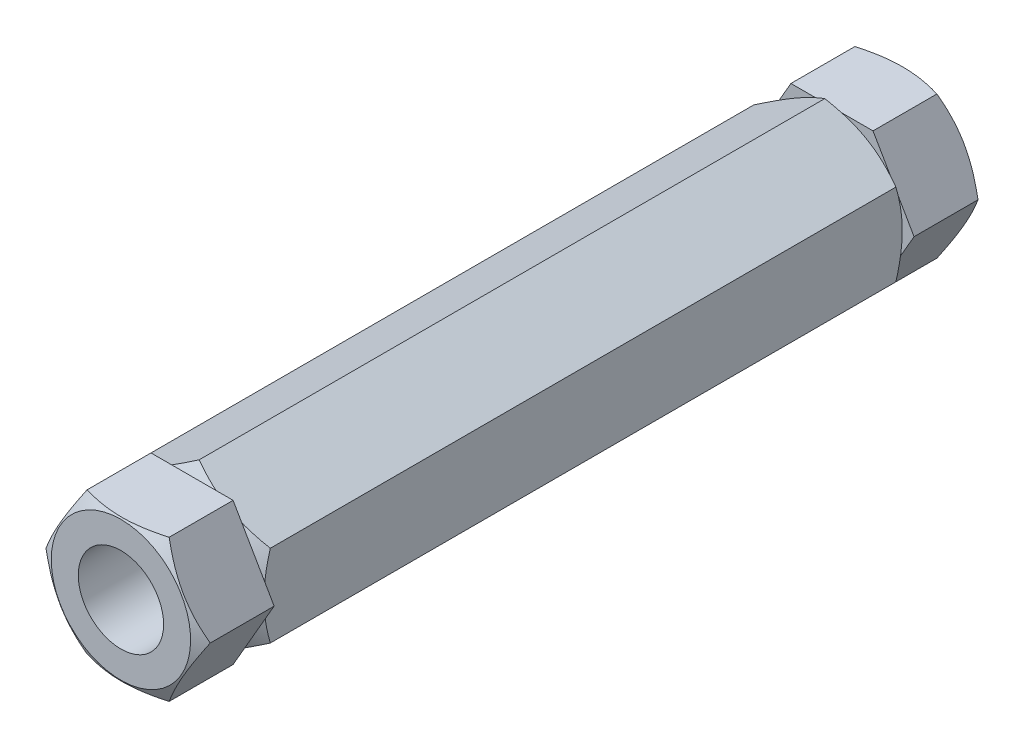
ISO-10303-21;
HEADER;
FILE_DESCRIPTION(('STEP AP214'),'2;1');
FILE_NAME('part.step','',(''),(''),'','','');
FILE_SCHEMA(('AUTOMOTIVE_DESIGN { 1 0 10303 214 1 1 1 1 }'));
ENDSEC;
DATA;
#1=APPLICATION_CONTEXT('core data for automotive mechanical design processes');
#2=APPLICATION_PROTOCOL_DEFINITION('international standard','automotive_design',2000,#1);
#3=PRODUCT_CONTEXT('',#1,'mechanical');
#4=PRODUCT('Part','Part','',(#3));
#5=PRODUCT_RELATED_PRODUCT_CATEGORY('part','',(#4));
#6=PRODUCT_DEFINITION_FORMATION('','',#4);
#7=PRODUCT_DEFINITION_CONTEXT('part definition',#1,'design');
#8=PRODUCT_DEFINITION('design','',#6,#7);
#9=PRODUCT_DEFINITION_SHAPE('','',#8);
#10=(LENGTH_UNIT() NAMED_UNIT(*) SI_UNIT(.MILLI.,.METRE.));
#11=(NAMED_UNIT(*) PLANE_ANGLE_UNIT() SI_UNIT($,.RADIAN.));
#12=(NAMED_UNIT(*) SI_UNIT($,.STERADIAN.) SOLID_ANGLE_UNIT());
#13=UNCERTAINTY_MEASURE_WITH_UNIT(LENGTH_MEASURE(1.E-05),#10,'distance_accuracy_value','');
#14=(GEOMETRIC_REPRESENTATION_CONTEXT(3) GLOBAL_UNCERTAINTY_ASSIGNED_CONTEXT((#13)) GLOBAL_UNIT_ASSIGNED_CONTEXT((#10,
#11,#12)) REPRESENTATION_CONTEXT('',''));
#15=CARTESIAN_POINT('',(0.,0.,0.));
#16=DIRECTION('',(0.,0.,1.));
#17=DIRECTION('',(1.,0.,0.));
#18=AXIS2_PLACEMENT_3D('',#15,#16,#17);
#19=CARTESIAN_POINT('',(0.,0.,55.));
#20=DIRECTION('',(0.,0.,-1.));
#21=DIRECTION('',(0.,-1.,0.));
#22=AXIS2_PLACEMENT_3D('',#19,#20,#21);
#23=CONICAL_SURFACE('',#22,4.9,1.0471975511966);
#24=CARTESIAN_POINT('',(2.88663587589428,-5.0002,54.4956163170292));
#25=CARTESIAN_POINT('',(3.01349970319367,-4.78046540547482,54.5688784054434));
#26=CARTESIAN_POINT('',(3.14144859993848,-4.55885141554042,54.6355136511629));
#27=CARTESIAN_POINT('',(3.3995619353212,-4.11178600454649,54.7518259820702));
#28=CARTESIAN_POINT('',(3.52973095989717,-3.88632664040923,54.8014619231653));
#29=CARTESIAN_POINT('',(3.78847564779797,-3.43816769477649,54.8787139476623));
#30=CARTESIAN_POINT('',(3.91701101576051,-3.21553790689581,54.9068445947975));
#31=CARTESIAN_POINT('',(4.11026620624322,-2.88081009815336,54.9320700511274));
#32=CARTESIAN_POINT('',(4.1747286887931,-2.76915780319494,54.9376515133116));
#33=CARTESIAN_POINT('',(4.30371322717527,-2.5457500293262,54.9430627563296));
#34=CARTESIAN_POINT('',(4.36823528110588,-2.43399455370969,54.9428927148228));
#35=CARTESIAN_POINT('',(4.54500768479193,-2.12781576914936,54.934511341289));
#36=CARTESIAN_POINT('',(4.65719946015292,-1.93349391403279,54.9204352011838));
#37=CARTESIAN_POINT('',(4.8808384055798,-1.5461398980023,54.8757997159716));
#38=CARTESIAN_POINT('',(4.99228478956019,-1.35310909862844,54.8452251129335));
#39=CARTESIAN_POINT('',(5.21637431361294,-0.964974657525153,54.7687964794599));
#40=CARTESIAN_POINT('',(5.32898917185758,-0.769920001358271,54.7226185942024));
#41=CARTESIAN_POINT('',(5.55253939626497,-0.382719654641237,54.6178131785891));
#42=CARTESIAN_POINT('',(5.66347762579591,-0.190569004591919,54.5592102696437));
#43=CARTESIAN_POINT('',(5.77361816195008,0.000199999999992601,54.4956163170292));
#44=B_SPLINE_CURVE_WITH_KNOTS('',3,(#24,#25,#26,#27,#28,#29,#30,#31,#32,#33,#34,#35,#36,#37,#38,
#39,#40,#41,#42,#43),.UNSPECIFIED.,.F.,.F.,(4,2,2,2,2,2,2,2,2,4),(0.,0.792555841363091,
1.58701660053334,2.36181537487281,2.74884076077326,3.13585419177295,3.80962362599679,
4.48401723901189,5.17336882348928,5.86136694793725),.UNSPECIFIED.);
#45=CARTESIAN_POINT('',(2.88675134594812,-5.,54.4956829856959));
#46=VERTEX_POINT('',#45);
#47=CARTESIAN_POINT('',(5.77350269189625,0.,54.4956829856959));
#48=VERTEX_POINT('',#47);
#49=EDGE_CURVE('E406',#46,#48,#44,.T.);
#50=ORIENTED_EDGE('',*,*,#49,.T.);
#51=CARTESIAN_POINT('',(2.88663587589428,5.0002,54.4956163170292));
#52=CARTESIAN_POINT('',(3.01349970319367,4.78046540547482,54.5688784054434));
#53=CARTESIAN_POINT('',(3.14144859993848,4.55885141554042,54.6355136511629));
#54=CARTESIAN_POINT('',(3.3995619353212,4.11178600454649,54.7518259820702));
#55=CARTESIAN_POINT('',(3.52973095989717,3.88632664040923,54.8014619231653));
#56=CARTESIAN_POINT('',(3.78847564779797,3.43816769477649,54.8787139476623));
#57=CARTESIAN_POINT('',(3.91701101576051,3.21553790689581,54.9068445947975));
#58=CARTESIAN_POINT('',(4.11026620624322,2.88081009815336,54.9320700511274));
#59=CARTESIAN_POINT('',(4.1747286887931,2.76915780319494,54.9376515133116));
#60=CARTESIAN_POINT('',(4.30371322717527,2.5457500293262,54.9430627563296));
#61=CARTESIAN_POINT('',(4.36823528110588,2.43399455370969,54.9428927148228));
#62=CARTESIAN_POINT('',(4.54500768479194,2.12781576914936,54.934511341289));
#63=CARTESIAN_POINT('',(4.65719946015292,1.93349391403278,54.9204352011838));
#64=CARTESIAN_POINT('',(4.88083840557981,1.54613989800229,54.8757997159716));
#65=CARTESIAN_POINT('',(4.9922847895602,1.35310909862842,54.8452251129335));
#66=CARTESIAN_POINT('',(5.21637431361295,0.964974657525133,54.7687964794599));
#67=CARTESIAN_POINT('',(5.32898917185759,0.76992000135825,54.7226185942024));
#68=CARTESIAN_POINT('',(5.55253939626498,0.382719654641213,54.6178131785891));
#69=CARTESIAN_POINT('',(5.66347762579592,0.190569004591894,54.5592102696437));
#70=CARTESIAN_POINT('',(5.7736181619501,-0.000200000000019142,54.4956163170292));
#71=B_SPLINE_CURVE_WITH_KNOTS('',3,(#51,#52,#53,#54,#55,#56,#57,#58,#59,#60,#61,#62,#63,#64,#65,
#66,#67,#68,#69,#70),.UNSPECIFIED.,.F.,.F.,(4,2,2,2,2,2,2,2,2,4),(0.,0.792555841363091,
1.58701660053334,2.36181537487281,2.74884076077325,3.13585419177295,3.8096236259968,
4.48401723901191,5.17336882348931,5.86136694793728),.UNSPECIFIED.);
#72=CARTESIAN_POINT('',(2.88675134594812,5.,54.4956829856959));
#73=VERTEX_POINT('',#72);
#74=EDGE_CURVE('E400',#73,#48,#71,.T.);
#75=ORIENTED_EDGE('',*,*,#74,.F.);
#76=CARTESIAN_POINT('',(7.69916314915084,5.,52.5287926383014));
#77=CARTESIAN_POINT('',(7.4812356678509,5.,52.6342846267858));
#78=CARTESIAN_POINT('',(7.26280196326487,5.,52.7387490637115));
#79=CARTESIAN_POINT('',(6.8246526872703,5.,52.9450437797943));
#80=CARTESIAN_POINT('',(6.60493691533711,5.,53.046873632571));
#81=CARTESIAN_POINT('',(6.16279540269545,5.,53.2478442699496));
#82=CARTESIAN_POINT('',(5.94036138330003,5.,53.3469669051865));
#83=CARTESIAN_POINT('',(5.49370479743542,5.,53.5410815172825));
#84=CARTESIAN_POINT('',(5.2694823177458,5.,53.6360736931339));
#85=CARTESIAN_POINT('',(4.81186990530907,5.,53.8237144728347));
#86=CARTESIAN_POINT('',(4.57841191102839,5.,53.9161980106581));
#87=CARTESIAN_POINT('',(4.10874431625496,5.,54.0940313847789));
#88=CARTESIAN_POINT('',(3.87253440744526,5.,54.1793804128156));
#89=CARTESIAN_POINT('',(3.39744748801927,5.,54.3406637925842));
#90=CARTESIAN_POINT('',(3.15857718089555,5.,54.4166176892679));
#91=CARTESIAN_POINT('',(2.67741088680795,5.,54.5566372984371));
#92=CARTESIAN_POINT('',(2.43511602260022,5.,54.6207068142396));
#93=CARTESIAN_POINT('',(1.9482975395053,5.,54.7335091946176));
#94=CARTESIAN_POINT('',(1.70379306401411,5.,54.7823231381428));
#95=CARTESIAN_POINT('',(1.21180206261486,5.,54.8618173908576));
#96=CARTESIAN_POINT('',(0.964315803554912,5.,54.8924993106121));
#97=CARTESIAN_POINT('',(0.470806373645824,5.,54.9328791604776));
#98=CARTESIAN_POINT('',(0.224805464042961,5.,54.9428424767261));
#99=CARTESIAN_POINT('',(-0.267162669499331,5.,54.9416356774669));
#100=CARTESIAN_POINT('',(-0.513129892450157,5.,54.9304650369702));
#101=CARTESIAN_POINT('',(-0.932362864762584,5.,54.8941965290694));
#102=CARTESIAN_POINT('',(-1.10608264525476,5.,54.8740605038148));
#103=CARTESIAN_POINT('',(-1.45220651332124,5.,54.8245302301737));
#104=CARTESIAN_POINT('',(-1.62461041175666,5.,54.7951346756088));
#105=CARTESIAN_POINT('',(-2.13964368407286,5.,54.6946084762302));
#106=CARTESIAN_POINT('',(-2.47989285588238,5.,54.6111580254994));
#107=CARTESIAN_POINT('',(-2.98858270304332,5.,54.4670150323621));
#108=CARTESIAN_POINT('',(-3.15967426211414,5.,54.4151496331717));
#109=CARTESIAN_POINT('',(-3.50019443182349,5.,54.3061726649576));
#110=CARTESIAN_POINT('',(-3.66962303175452,5.,54.249061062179));
#111=CARTESIAN_POINT('',(-4.00687370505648,5.,54.1304964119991));
#112=CARTESIAN_POINT('',(-4.17469631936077,5.,54.0690448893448));
#113=CARTESIAN_POINT('',(-4.50896068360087,5.,53.9425092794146));
#114=CARTESIAN_POINT('',(-4.67540244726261,5.,53.8774252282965));
#115=CARTESIAN_POINT('',(-5.0577827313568,5.,53.7238596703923));
#116=CARTESIAN_POINT('',(-5.27329135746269,5.,53.6343099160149));
#117=CARTESIAN_POINT('',(-5.7025610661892,5.,53.4511047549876));
#118=CARTESIAN_POINT('',(-5.91632205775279,5.,53.357449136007));
#119=CARTESIAN_POINT('',(-6.3424054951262,5.,53.1668292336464));
#120=CARTESIAN_POINT('',(-6.55472767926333,5.,53.0698643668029));
#121=CARTESIAN_POINT('',(-6.978132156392,5.,52.8732605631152));
#122=CARTESIAN_POINT('',(-7.18921442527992,5.,52.7736215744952));
#123=CARTESIAN_POINT('',(-7.82128006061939,5.,52.471267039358));
#124=CARTESIAN_POINT('',(-8.24070087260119,5.,52.2652867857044));
#125=CARTESIAN_POINT('',(-9.07656071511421,5.,51.8473636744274));
#126=CARTESIAN_POINT('',(-9.49299964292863,5.,51.6354206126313));
#127=CARTESIAN_POINT('',(-10.0994332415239,5.,51.322834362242));
#128=CARTESIAN_POINT('',(-10.2903000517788,5.,51.2238782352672));
#129=CARTESIAN_POINT('',(-10.6716183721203,5.,51.0251770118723));
#130=CARTESIAN_POINT('',(-10.8620698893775,5.,50.9254319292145));
#131=CARTESIAN_POINT('',(-11.4328987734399,5.,50.6251625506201));
#132=CARTESIAN_POINT('',(-11.8127361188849,5.,50.4236115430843));
#133=CARTESIAN_POINT('',(-12.5704213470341,5.,50.0188767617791));
#134=CARTESIAN_POINT('',(-12.9482717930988,5.,49.8156977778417));
#135=CARTESIAN_POINT('',(-13.7030537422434,5.,49.4076849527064));
#136=CARTESIAN_POINT('',(-14.0799852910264,5.,49.2028511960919));
#137=CARTESIAN_POINT('',(-14.4565754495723,5.,48.9973955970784));
#138=B_SPLINE_CURVE_WITH_KNOTS('',3,(#76,#77,#78,#79,#80,#81,#82,#83,#84,#85,#86,#87,#88,#89,
#90,#91,#92,#93,#94,#95,#96,#97,#98,#99,#100,#101,#102,#103,#104,#105,#106,#107,#108,#109,#110,
#111,#112,#113,#114,#115,#116,#117,#118,#119,#120,#121,#122,#123,#124,#125,#126,#127,#128,#129,
#130,#131,#132,#133,#134,#135,#136,#137),.UNSPECIFIED.,.F.,.F.,(4,2,2,2,2,2,2,2,2,2,2,2,2,2,2,2,
2,2,2,2,2,2,2,2,2,2,2,2,2,2,4),(0.,0.726362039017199,1.45284090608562,2.18336853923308,
2.91386093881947,3.66709851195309,4.42042130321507,5.17214959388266,5.92363689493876,
6.67105952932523,7.41841576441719,8.15613856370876,8.89387968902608,9.41827283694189,
9.9427399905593,10.9922797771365,11.5285766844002,12.0648770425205,12.600989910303,
13.1370974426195,13.8371612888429,14.5372613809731,15.2374855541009,15.9377232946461,
17.3394546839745,18.741234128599,19.3862148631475,20.0311843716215,21.321171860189,
22.6082083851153,23.8951795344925),.UNSPECIFIED.);
#139=CARTESIAN_POINT('',(-2.88675134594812,5.,54.4956829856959));
#140=VERTEX_POINT('',#139);
#141=EDGE_CURVE('E393',#73,#140,#138,.T.);
#142=ORIENTED_EDGE('',*,*,#141,.T.);
#143=CARTESIAN_POINT('',(-2.88663587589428,5.0002,54.4956163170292));
#144=CARTESIAN_POINT('',(-3.01349970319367,4.78046540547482,54.5688784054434));
#145=CARTESIAN_POINT('',(-3.14144859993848,4.55885141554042,54.6355136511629));
#146=CARTESIAN_POINT('',(-3.3995619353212,4.11178600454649,54.7518259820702));
#147=CARTESIAN_POINT('',(-3.52973095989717,3.88632664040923,54.8014619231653));
#148=CARTESIAN_POINT('',(-3.78847564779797,3.43816769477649,54.8787139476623));
#149=CARTESIAN_POINT('',(-3.91701101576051,3.21553790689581,54.9068445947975));
#150=CARTESIAN_POINT('',(-4.11026620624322,2.88081009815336,54.9320700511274));
#151=CARTESIAN_POINT('',(-4.1747286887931,2.76915780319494,54.9376515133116));
#152=CARTESIAN_POINT('',(-4.30371322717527,2.5457500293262,54.9430627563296));
#153=CARTESIAN_POINT('',(-4.36823528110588,2.43399455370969,54.9428927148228));
#154=CARTESIAN_POINT('',(-4.54500768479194,2.12781576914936,54.934511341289));
#155=CARTESIAN_POINT('',(-4.65719946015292,1.93349391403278,54.9204352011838));
#156=CARTESIAN_POINT('',(-4.88083840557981,1.54613989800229,54.8757997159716));
#157=CARTESIAN_POINT('',(-4.9922847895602,1.35310909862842,54.8452251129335));
#158=CARTESIAN_POINT('',(-5.21637431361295,0.964974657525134,54.7687964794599));
#159=CARTESIAN_POINT('',(-5.32898917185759,0.769920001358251,54.7226185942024));
#160=CARTESIAN_POINT('',(-5.55253939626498,0.382719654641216,54.6178131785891));
#161=CARTESIAN_POINT('',(-5.66347762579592,0.190569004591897,54.5592102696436));
#162=CARTESIAN_POINT('',(-5.7736181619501,-0.000200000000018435,54.4956163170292));
#163=B_SPLINE_CURVE_WITH_KNOTS('',3,(#143,#144,#145,#146,#147,#148,#149,#150,#151,#152,#153,
#154,#155,#156,#157,#158,#159,#160,#161,#162),.UNSPECIFIED.,.F.,.F.,(4,2,2,2,2,2,2,2,2,4),(0.,
0.792555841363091,1.58701660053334,2.36181537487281,2.74884076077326,3.13585419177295,
3.8096236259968,4.48401723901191,5.17336882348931,5.86136694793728),.UNSPECIFIED.);
#164=CARTESIAN_POINT('',(-5.77350269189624,0.,54.4956829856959));
#165=VERTEX_POINT('',#164);
#166=EDGE_CURVE('E34',#140,#165,#163,.T.);
#167=ORIENTED_EDGE('',*,*,#166,.T.);
#168=CARTESIAN_POINT('',(-2.88663587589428,-5.0002,54.4956163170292));
#169=CARTESIAN_POINT('',(-3.01349970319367,-4.78046540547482,54.5688784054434));
#170=CARTESIAN_POINT('',(-3.14144859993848,-4.55885141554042,54.6355136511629));
#171=CARTESIAN_POINT('',(-3.3995619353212,-4.11178600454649,54.7518259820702));
#172=CARTESIAN_POINT('',(-3.52973095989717,-3.88632664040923,54.8014619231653));
#173=CARTESIAN_POINT('',(-3.78847564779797,-3.43816769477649,54.8787139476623));
#174=CARTESIAN_POINT('',(-3.91701101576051,-3.21553790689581,54.9068445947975));
#175=CARTESIAN_POINT('',(-4.11026620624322,-2.88081009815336,54.9320700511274));
#176=CARTESIAN_POINT('',(-4.1747286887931,-2.76915780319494,54.9376515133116));
#177=CARTESIAN_POINT('',(-4.30371322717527,-2.5457500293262,54.9430627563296));
#178=CARTESIAN_POINT('',(-4.36823528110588,-2.43399455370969,54.9428927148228));
#179=CARTESIAN_POINT('',(-4.54500768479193,-2.12781576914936,54.934511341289));
#180=CARTESIAN_POINT('',(-4.65719946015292,-1.93349391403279,54.9204352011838));
#181=CARTESIAN_POINT('',(-4.8808384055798,-1.5461398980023,54.8757997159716));
#182=CARTESIAN_POINT('',(-4.99228478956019,-1.35310909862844,54.8452251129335));
#183=CARTESIAN_POINT('',(-5.21637431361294,-0.964974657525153,54.7687964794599));
#184=CARTESIAN_POINT('',(-5.32898917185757,-0.769920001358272,54.7226185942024));
#185=CARTESIAN_POINT('',(-5.55253939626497,-0.382719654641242,54.6178131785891));
#186=CARTESIAN_POINT('',(-5.6634776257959,-0.190569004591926,54.5592102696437));
#187=CARTESIAN_POINT('',(-5.77361816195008,0.000199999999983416,54.4956163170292));
#188=B_SPLINE_CURVE_WITH_KNOTS('',3,(#168,#169,#170,#171,#172,#173,#174,#175,#176,#177,#178,
#179,#180,#181,#182,#183,#184,#185,#186,#187),.UNSPECIFIED.,.F.,.F.,(4,2,2,2,2,2,2,2,2,4),(0.,
0.792555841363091,1.58701660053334,2.36181537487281,2.74884076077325,3.13585419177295,
3.80962362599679,4.48401723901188,5.17336882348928,5.86136694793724),.UNSPECIFIED.);
#189=CARTESIAN_POINT('',(-2.88675134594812,-5.,54.4956829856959));
#190=VERTEX_POINT('',#189);
#191=EDGE_CURVE('E375',#190,#165,#188,.T.);
#192=ORIENTED_EDGE('',*,*,#191,.F.);
#193=CARTESIAN_POINT('',(7.69916314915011,-5.,52.5287926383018));
#194=CARTESIAN_POINT('',(7.48123566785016,-5.,52.6342846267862));
#195=CARTESIAN_POINT('',(7.26280196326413,-5.,52.7387490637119));
#196=CARTESIAN_POINT('',(6.82465268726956,-5.,52.9450437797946));
#197=CARTESIAN_POINT('',(6.60493691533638,-5.,53.0468736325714));
#198=CARTESIAN_POINT('',(6.16279540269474,-5.,53.24784426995));
#199=CARTESIAN_POINT('',(5.94036138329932,-5.,53.3469669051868));
#200=CARTESIAN_POINT('',(5.49370479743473,-5.,53.5410815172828));
#201=CARTESIAN_POINT('',(5.26948231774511,-5.,53.6360736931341));
#202=CARTESIAN_POINT('',(4.8118699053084,-5.,53.823714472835));
#203=CARTESIAN_POINT('',(4.57841191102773,-5.,53.9161980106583));
#204=CARTESIAN_POINT('',(4.10874431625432,-5.,54.0940313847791));
#205=CARTESIAN_POINT('',(3.87253440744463,-5.,54.1793804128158));
#206=CARTESIAN_POINT('',(3.39744748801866,-5.,54.3406637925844));
#207=CARTESIAN_POINT('',(3.15857718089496,-5.,54.4166176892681));
#208=CARTESIAN_POINT('',(2.67741088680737,-5.,54.5566372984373));
#209=CARTESIAN_POINT('',(2.43511602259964,-5.,54.6207068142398));
#210=CARTESIAN_POINT('',(1.94829753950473,-5.,54.7335091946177));
#211=CARTESIAN_POINT('',(1.70379306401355,-5.,54.7823231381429));
#212=CARTESIAN_POINT('',(1.21180206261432,-5.,54.8618173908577));
#213=CARTESIAN_POINT('',(0.964315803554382,-5.,54.8924993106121));
#214=CARTESIAN_POINT('',(0.47080637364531,-5.,54.9328791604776));
#215=CARTESIAN_POINT('',(0.224805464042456,-5.,54.9428424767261));
#216=CARTESIAN_POINT('',(-0.267162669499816,-5.,54.9416356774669));
#217=CARTESIAN_POINT('',(-0.513129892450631,-5.,54.9304650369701));
#218=CARTESIAN_POINT('',(-0.93236286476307,-5.,54.8941965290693));
#219=CARTESIAN_POINT('',(-1.10608264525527,-5.,54.8740605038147));
#220=CARTESIAN_POINT('',(-1.45220651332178,-5.,54.8245302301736));
#221=CARTESIAN_POINT('',(-1.62461041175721,-5.,54.7951346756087));
#222=CARTESIAN_POINT('',(-2.13964368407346,-5.,54.69460847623));
#223=CARTESIAN_POINT('',(-2.479892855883,-5.,54.6111580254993));
#224=CARTESIAN_POINT('',(-2.98858270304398,-5.,54.4670150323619));
#225=CARTESIAN_POINT('',(-3.15967426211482,-5.,54.4151496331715));
#226=CARTESIAN_POINT('',(-3.50019443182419,-5.,54.3061726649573));
#227=CARTESIAN_POINT('',(-3.66962303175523,-5.,54.2490610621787));
#228=CARTESIAN_POINT('',(-4.00687370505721,-5.,54.1304964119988));
#229=CARTESIAN_POINT('',(-4.17469631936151,-5.,54.0690448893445));
#230=CARTESIAN_POINT('',(-4.50896068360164,-5.,53.9425092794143));
#231=CARTESIAN_POINT('',(-4.6754024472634,-5.,53.8774252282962));
#232=CARTESIAN_POINT('',(-5.05778273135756,-5.,53.723859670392));
#233=CARTESIAN_POINT('',(-5.27329135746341,-5.,53.6343099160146));
#234=CARTESIAN_POINT('',(-5.70256106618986,-5.,53.4511047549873));
#235=CARTESIAN_POINT('',(-5.91632205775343,-5.,53.3574491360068));
#236=CARTESIAN_POINT('',(-6.34240549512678,-5.,53.1668292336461));
#237=CARTESIAN_POINT('',(-6.55472767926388,-5.,53.0698643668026));
#238=CARTESIAN_POINT('',(-6.97813215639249,-5.,52.873260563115));
#239=CARTESIAN_POINT('',(-7.18921442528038,-5.,52.773621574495));
#240=CARTESIAN_POINT('',(-7.82128006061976,-5.,52.4712670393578));
#241=CARTESIAN_POINT('',(-8.2407008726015,-5.,52.2652867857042));
#242=CARTESIAN_POINT('',(-9.07656071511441,-5.,51.8473636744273));
#243=CARTESIAN_POINT('',(-9.49299964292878,-5.,51.6354206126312));
#244=CARTESIAN_POINT('',(-10.0994332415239,-5.,51.322834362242));
#245=CARTESIAN_POINT('',(-10.2903000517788,-5.,51.2238782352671));
#246=CARTESIAN_POINT('',(-10.6716183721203,-5.,51.0251770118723));
#247=CARTESIAN_POINT('',(-10.8620698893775,-5.,50.9254319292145));
#248=CARTESIAN_POINT('',(-11.4328987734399,-5.,50.6251625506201));
#249=CARTESIAN_POINT('',(-11.8127361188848,-5.,50.4236115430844));
#250=CARTESIAN_POINT('',(-12.5704213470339,-5.,50.0188767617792));
#251=CARTESIAN_POINT('',(-12.9482717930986,-5.,49.8156977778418));
#252=CARTESIAN_POINT('',(-13.7030537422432,-5.,49.4076849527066));
#253=CARTESIAN_POINT('',(-14.0799852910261,-5.,49.2028511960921));
#254=CARTESIAN_POINT('',(-14.456575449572,-5.,48.9973955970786));
#255=B_SPLINE_CURVE_WITH_KNOTS('',3,(#193,#194,#195,#196,#197,#198,#199,#200,#201,#202,#203,
#204,#205,#206,#207,#208,#209,#210,#211,#212,#213,#214,#215,#216,#217,#218,#219,#220,#221,#222,
#223,#224,#225,#226,#227,#228,#229,#230,#231,#232,#233,#234,#235,#236,#237,#238,#239,#240,#241,
#242,#243,#244,#245,#246,#247,#248,#249,#250,#251,#252,#253,#254),.UNSPECIFIED.,.F.,.F.,(4,2,2,
2,2,2,2,2,2,2,2,2,2,2,2,2,2,2,2,2,2,2,2,2,2,2,2,2,2,2,4),(0.,0.726362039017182,1.45284090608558,
2.18336853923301,2.91386093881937,3.66709851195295,4.42042130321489,5.17214959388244,
5.92363689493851,6.67105952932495,7.41841576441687,8.15613856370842,8.89387968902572,
9.41827283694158,9.94273999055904,10.9922797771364,11.5285766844,12.0648770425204,
12.600989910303,13.1370974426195,13.8371612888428,14.5372613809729,15.2374855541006,
15.9377232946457,17.339454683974,18.7412341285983,19.3862148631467,20.0311843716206,
21.321171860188,22.6082083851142,23.8951795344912),.UNSPECIFIED.);
#256=EDGE_CURVE('E411',#46,#190,#255,.T.);
#257=ORIENTED_EDGE('',*,*,#256,.F.);
#258=EDGE_LOOP('',(#50,#75,#142,#167,#192,#257));
#259=FACE_BOUND('',#258,.T.);
#260=CARTESIAN_POINT('',(0.,0.,55.));
#261=DIRECTION('',(0.,0.,1.));
#262=DIRECTION('',(0.,1.,0.));
#263=AXIS2_PLACEMENT_3D('',#260,#261,#262);
#264=CIRCLE('',#263,4.9);
#265=CARTESIAN_POINT('',(0.,4.9,55.));
#266=VERTEX_POINT('',#265);
#267=EDGE_CURVE('E482',#266,#266,#264,.T.);
#268=ORIENTED_EDGE('',*,*,#267,.F.);
#269=EDGE_LOOP('',(#268));
#270=FACE_BOUND('',#269,.T.);
#271=ADVANCED_FACE('F14',(#259,#270),#23,.T.);
#272=CARTESIAN_POINT('',(-2.88675134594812,-5.,55.));
#273=DIRECTION('',(0.,0.,1.));
#274=DIRECTION('',(0.,1.,0.));
#275=AXIS2_PLACEMENT_3D('',#272,#273,#274);
#276=PLANE('',#275);
#277=CARTESIAN_POINT('',(0.,0.,55.));
#278=DIRECTION('',(0.,0.,1.));
#279=DIRECTION('',(0.,1.,0.));
#280=AXIS2_PLACEMENT_3D('',#277,#278,#279);
#281=CIRCLE('',#280,3.);
#282=CARTESIAN_POINT('',(0.,3.,55.));
#283=VERTEX_POINT('',#282);
#284=EDGE_CURVE('E419',#283,#283,#281,.T.);
#285=ORIENTED_EDGE('',*,*,#284,.F.);
#286=EDGE_LOOP('',(#285));
#287=FACE_BOUND('',#286,.T.);
#288=ORIENTED_EDGE('',*,*,#267,.T.);
#289=EDGE_LOOP('',(#288));
#290=FACE_BOUND('',#289,.T.);
#291=ADVANCED_FACE('F360',(#287,#290),#276,.T.);
#292=CARTESIAN_POINT('',(0.,0.,55.));
#293=DIRECTION('',(0.,0.,-1.));
#294=DIRECTION('',(1.,0.,0.));
#295=AXIS2_PLACEMENT_3D('',#292,#293,#294);
#296=CYLINDRICAL_SURFACE('',#295,3.);
#297=ORIENTED_EDGE('',*,*,#284,.T.);
#298=EDGE_LOOP('',(#297));
#299=FACE_BOUND('',#298,.T.);
#300=CARTESIAN_POINT('',(0.,0.,0.));
#301=DIRECTION('',(0.,0.,-1.));
#302=DIRECTION('',(0.,-1.,0.));
#303=AXIS2_PLACEMENT_3D('',#300,#301,#302);
#304=CIRCLE('',#303,3.);
#305=CARTESIAN_POINT('',(0.,-3.,0.));
#306=VERTEX_POINT('',#305);
#307=EDGE_CURVE('E513',#306,#306,#304,.T.);
#308=ORIENTED_EDGE('',*,*,#307,.T.);
#309=EDGE_LOOP('',(#308));
#310=FACE_BOUND('',#309,.T.);
#311=ADVANCED_FACE('F365',(#299,#310),#296,.F.);
#312=CARTESIAN_POINT('',(2.88675134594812,-5.,55.));
#313=DIRECTION('',(0.,-1.,0.));
#314=DIRECTION('',(0.,0.,1.));
#315=AXIS2_PLACEMENT_3D('',#312,#313,#314);
#316=PLANE('',#315);
#317=DIRECTION('',(-1.,0.,0.));
#318=VECTOR('',#317,1.);
#319=CARTESIAN_POINT('',(2.88675134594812,-5.,50.));
#320=LINE('',#319,#318);
#321=CARTESIAN_POINT('',(2.88675134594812,-5.,50.));
#322=VERTEX_POINT('',#321);
#323=CARTESIAN_POINT('',(-2.88675134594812,-5.,50.));
#324=VERTEX_POINT('',#323);
#325=EDGE_CURVE('E480',#322,#324,#320,.T.);
#326=ORIENTED_EDGE('',*,*,#325,.F.);
#327=DIRECTION('',(0.,0.,-1.));
#328=VECTOR('',#327,1.);
#329=CARTESIAN_POINT('',(2.88675134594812,-5.,55.));
#330=LINE('',#329,#328);
#331=EDGE_CURVE('E25',#46,#322,#330,.T.);
#332=ORIENTED_EDGE('',*,*,#331,.F.);
#333=ORIENTED_EDGE('',*,*,#256,.T.);
#334=DIRECTION('',(0.,0.,-1.));
#335=VECTOR('',#334,1.);
#336=CARTESIAN_POINT('',(-2.88675134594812,-5.,55.));
#337=LINE('',#336,#335);
#338=EDGE_CURVE('E501',#190,#324,#337,.T.);
#339=ORIENTED_EDGE('',*,*,#338,.T.);
#340=EDGE_LOOP('',(#326,#332,#333,#339));
#341=FACE_BOUND('',#340,.T.);
#342=ADVANCED_FACE('F421',(#341),#316,.T.);
#343=CARTESIAN_POINT('',(2.88675134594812,-5.,55.));
#344=DIRECTION('',(-0.86602540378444,0.5,0.));
#345=DIRECTION('',(-0.5,-0.86602540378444,0.));
#346=AXIS2_PLACEMENT_3D('',#343,#344,#345);
#347=PLANE('',#346);
#348=DIRECTION('',(-0.5,-0.866025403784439,0.));
#349=VECTOR('',#348,1.);
#350=CARTESIAN_POINT('',(5.77350269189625,0.,50.));
#351=LINE('',#350,#349);
#352=CARTESIAN_POINT('',(5.77350269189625,0.,50.));
#353=VERTEX_POINT('',#352);
#354=EDGE_CURVE('E465',#353,#322,#351,.T.);
#355=ORIENTED_EDGE('',*,*,#354,.F.);
#356=DIRECTION('',(0.,0.,-1.));
#357=VECTOR('',#356,1.);
#358=CARTESIAN_POINT('',(5.77350269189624,0.,55.));
#359=LINE('',#358,#357);
#360=EDGE_CURVE('E459',#48,#353,#359,.T.);
#361=ORIENTED_EDGE('',*,*,#360,.F.);
#362=ORIENTED_EDGE('',*,*,#49,.F.);
#363=ORIENTED_EDGE('',*,*,#331,.T.);
#364=EDGE_LOOP('',(#355,#361,#362,#363));
#365=FACE_BOUND('',#364,.T.);
#366=ADVANCED_FACE('F211',(#365),#347,.F.);
#367=CARTESIAN_POINT('',(2.88675134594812,5.,55.));
#368=DIRECTION('',(0.86602540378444,0.5,0.));
#369=DIRECTION('',(-0.5,0.86602540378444,0.));
#370=AXIS2_PLACEMENT_3D('',#367,#368,#369);
#371=PLANE('',#370);
#372=DIRECTION('',(0.499999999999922,-0.866025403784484,0.));
#373=VECTOR('',#372,1.);
#374=CARTESIAN_POINT('',(2.88675134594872,5.,50.));
#375=LINE('',#374,#373);
#376=CARTESIAN_POINT('',(2.88675134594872,5.,50.));
#377=VERTEX_POINT('',#376);
#378=EDGE_CURVE('E451',#377,#353,#375,.T.);
#379=ORIENTED_EDGE('',*,*,#378,.F.);
#380=DIRECTION('',(0.,0.,-1.));
#381=VECTOR('',#380,1.);
#382=CARTESIAN_POINT('',(2.88675134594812,5.,55.));
#383=LINE('',#382,#381);
#384=EDGE_CURVE('E456',#73,#377,#383,.T.);
#385=ORIENTED_EDGE('',*,*,#384,.F.);
#386=ORIENTED_EDGE('',*,*,#74,.T.);
#387=ORIENTED_EDGE('',*,*,#360,.T.);
#388=EDGE_LOOP('',(#379,#385,#386,#387));
#389=FACE_BOUND('',#388,.T.);
#390=ADVANCED_FACE('F437',(#389),#371,.T.);
#391=CARTESIAN_POINT('',(2.88675134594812,5.,55.));
#392=DIRECTION('',(0.,-1.,0.));
#393=DIRECTION('',(0.,0.,1.));
#394=AXIS2_PLACEMENT_3D('',#391,#392,#393);
#395=PLANE('',#394);
#396=DIRECTION('',(1.,0.,0.));
#397=VECTOR('',#396,1.);
#398=CARTESIAN_POINT('',(-2.88675134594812,5.,50.));
#399=LINE('',#398,#397);
#400=CARTESIAN_POINT('',(-2.88675134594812,5.,50.));
#401=VERTEX_POINT('',#400);
#402=EDGE_CURVE('E466',#401,#377,#399,.T.);
#403=ORIENTED_EDGE('',*,*,#402,.F.);
#404=DIRECTION('',(0.,0.,-1.));
#405=VECTOR('',#404,1.);
#406=CARTESIAN_POINT('',(-2.88675134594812,5.,55.));
#407=LINE('',#406,#405);
#408=EDGE_CURVE('E495',#140,#401,#407,.T.);
#409=ORIENTED_EDGE('',*,*,#408,.F.);
#410=ORIENTED_EDGE('',*,*,#141,.F.);
#411=ORIENTED_EDGE('',*,*,#384,.T.);
#412=EDGE_LOOP('',(#403,#409,#410,#411));
#413=FACE_BOUND('',#412,.T.);
#414=ADVANCED_FACE('F433',(#413),#395,.F.);
#415=CARTESIAN_POINT('',(-2.88675134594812,5.,55.));
#416=DIRECTION('',(0.86602540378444,-0.5,0.));
#417=DIRECTION('',(0.5,0.86602540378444,0.));
#418=AXIS2_PLACEMENT_3D('',#415,#416,#417);
#419=PLANE('',#418);
#420=DIRECTION('',(0.5,0.866025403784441,0.));
#421=VECTOR('',#420,1.);
#422=CARTESIAN_POINT('',(-5.77350269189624,0.,50.));
#423=LINE('',#422,#421);
#424=CARTESIAN_POINT('',(-5.77350269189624,0.,50.));
#425=VERTEX_POINT('',#424);
#426=EDGE_CURVE('E472',#425,#401,#423,.T.);
#427=ORIENTED_EDGE('',*,*,#426,.F.);
#428=DIRECTION('',(0.,0.,-1.));
#429=VECTOR('',#428,1.);
#430=CARTESIAN_POINT('',(-5.77350269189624,0.,55.));
#431=LINE('',#430,#429);
#432=EDGE_CURVE('E500',#165,#425,#431,.T.);
#433=ORIENTED_EDGE('',*,*,#432,.F.);
#434=ORIENTED_EDGE('',*,*,#166,.F.);
#435=ORIENTED_EDGE('',*,*,#408,.T.);
#436=EDGE_LOOP('',(#427,#433,#434,#435));
#437=FACE_BOUND('',#436,.T.);
#438=ADVANCED_FACE('F429',(#437),#419,.F.);
#439=CARTESIAN_POINT('',(-2.88675134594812,-5.,55.));
#440=DIRECTION('',(-0.86602540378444,-0.5,0.));
#441=DIRECTION('',(0.5,-0.86602540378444,0.));
#442=AXIS2_PLACEMENT_3D('',#439,#440,#441);
#443=PLANE('',#442);
#444=DIRECTION('',(-0.5,0.866025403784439,0.));
#445=VECTOR('',#444,1.);
#446=CARTESIAN_POINT('',(-2.88675134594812,-5.,50.));
#447=LINE('',#446,#445);
#448=EDGE_CURVE('E475',#324,#425,#447,.T.);
#449=ORIENTED_EDGE('',*,*,#448,.F.);
#450=ORIENTED_EDGE('',*,*,#338,.F.);
#451=ORIENTED_EDGE('',*,*,#191,.T.);
#452=ORIENTED_EDGE('',*,*,#432,.T.);
#453=EDGE_LOOP('',(#449,#450,#451,#452));
#454=FACE_BOUND('',#453,.T.);
#455=ADVANCED_FACE('F426',(#454),#443,.T.);
#456=CARTESIAN_POINT('',(-8.66025403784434,-5.,50.));
#457=DIRECTION('',(0.,0.,1.));
#458=DIRECTION('',(-1.,0.,0.));
#459=AXIS2_PLACEMENT_3D('',#456,#457,#458);
#460=PLANE('',#459);
#461=CARTESIAN_POINT('',(0.,0.,50.));
#462=DIRECTION('',(0.,0.,1.));
#463=DIRECTION('',(1.,0.,0.));
#464=AXIS2_PLACEMENT_3D('',#461,#462,#463);
#465=CIRCLE('',#464,4.9);
#466=CARTESIAN_POINT('',(4.9,0.,50.));
#467=VERTEX_POINT('',#466);
#468=EDGE_CURVE('E9',#467,#467,#465,.T.);
#469=ORIENTED_EDGE('',*,*,#468,.T.);
#470=EDGE_LOOP('',(#469));
#471=FACE_BOUND('',#470,.T.);
#472=ORIENTED_EDGE('',*,*,#448,.T.);
#473=ORIENTED_EDGE('',*,*,#426,.T.);
#474=ORIENTED_EDGE('',*,*,#402,.T.);
#475=ORIENTED_EDGE('',*,*,#378,.T.);
#476=ORIENTED_EDGE('',*,*,#354,.T.);
#477=ORIENTED_EDGE('',*,*,#325,.T.);
#478=EDGE_LOOP('',(#472,#473,#474,#475,#476,#477));
#479=FACE_BOUND('',#478,.T.);
#480=ADVANCED_FACE('F210',(#471,#479),#460,.F.);
#481=CARTESIAN_POINT('',(2.88675134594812,5.,0.));
#482=DIRECTION('',(0.,1.,0.));
#483=DIRECTION('',(0.,0.,-1.));
#484=AXIS2_PLACEMENT_3D('',#481,#482,#483);
#485=PLANE('',#484);
#486=DIRECTION('',(-1.,0.,0.));
#487=VECTOR('',#486,1.);
#488=CARTESIAN_POINT('',(2.88675134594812,5.,5.));
#489=LINE('',#488,#487);
#490=CARTESIAN_POINT('',(2.88675134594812,5.,5.));
#491=VERTEX_POINT('',#490);
#492=CARTESIAN_POINT('',(-2.88675134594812,5.,5.));
#493=VERTEX_POINT('',#492);
#494=EDGE_CURVE('E178',#491,#493,#489,.T.);
#495=ORIENTED_EDGE('',*,*,#494,.F.);
#496=DIRECTION('',(0.,0.,1.));
#497=VECTOR('',#496,1.);
#498=CARTESIAN_POINT('',(2.88675134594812,5.,0.));
#499=LINE('',#498,#497);
#500=CARTESIAN_POINT('',(2.88675134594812,5.,0.504317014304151));
#501=VERTEX_POINT('',#500);
#502=EDGE_CURVE('E527',#501,#491,#499,.T.);
#503=ORIENTED_EDGE('',*,*,#502,.F.);
#504=CARTESIAN_POINT('',(7.69916314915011,5.,2.4712073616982));
#505=CARTESIAN_POINT('',(7.48123566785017,5.,2.36571537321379));
#506=CARTESIAN_POINT('',(7.26280196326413,5.,2.2612509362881));
#507=CARTESIAN_POINT('',(6.82465268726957,5.,2.05495622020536));
#508=CARTESIAN_POINT('',(6.60493691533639,5.,1.95312636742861));
#509=CARTESIAN_POINT('',(6.16279540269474,5.,1.75215573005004));
#510=CARTESIAN_POINT('',(5.94036138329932,5.,1.6530330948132));
#511=CARTESIAN_POINT('',(5.49370479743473,5.,1.45891848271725));
#512=CARTESIAN_POINT('',(5.26948231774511,5.,1.36392630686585));
#513=CARTESIAN_POINT('',(4.8118699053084,5.,1.17628552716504));
#514=CARTESIAN_POINT('',(4.57841191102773,5.,1.08380198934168));
#515=CARTESIAN_POINT('',(4.10874431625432,5.,0.905968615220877));
#516=CARTESIAN_POINT('',(3.87253440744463,5.,0.820619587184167));
#517=CARTESIAN_POINT('',(3.39744748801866,5.,0.659336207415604));
#518=CARTESIAN_POINT('',(3.15857718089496,5.,0.583382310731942));
#519=CARTESIAN_POINT('',(2.67741088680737,5.,0.443362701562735));
#520=CARTESIAN_POINT('',(2.43511602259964,5.,0.379293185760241));
#521=CARTESIAN_POINT('',(1.94829753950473,5.,0.266490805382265));
#522=CARTESIAN_POINT('',(1.70379306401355,5.,0.217676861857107));
#523=CARTESIAN_POINT('',(1.21180206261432,5.,0.1381826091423));
#524=CARTESIAN_POINT('',(0.964315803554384,5.,0.107500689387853));
#525=CARTESIAN_POINT('',(0.470806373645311,5.,0.0671208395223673));
#526=CARTESIAN_POINT('',(0.224805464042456,5.,0.0571575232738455));
#527=CARTESIAN_POINT('',(-0.267162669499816,5.,0.0583643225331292));
#528=CARTESIAN_POINT('',(-0.513129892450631,5.,0.0695349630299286));
#529=CARTESIAN_POINT('',(-0.932362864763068,5.,0.10580347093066));
#530=CARTESIAN_POINT('',(-1.10608264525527,5.,0.125939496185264));
#531=CARTESIAN_POINT('',(-1.45220651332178,5.,0.175469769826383));
#532=CARTESIAN_POINT('',(-1.62461041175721,5.,0.204865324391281));
#533=CARTESIAN_POINT('',(-2.13964368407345,5.,0.305391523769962));
#534=CARTESIAN_POINT('',(-2.479892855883,5.,0.388841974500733));
#535=CARTESIAN_POINT('',(-2.98858270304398,5.,0.532984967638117));
#536=CARTESIAN_POINT('',(-3.15967426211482,5.,0.584850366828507));
#537=CARTESIAN_POINT('',(-3.50019443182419,5.,0.693827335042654));
#538=CARTESIAN_POINT('',(-3.66962303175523,5.,0.750938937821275));
#539=CARTESIAN_POINT('',(-4.00687370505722,5.,0.869503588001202));
#540=CARTESIAN_POINT('',(-4.17469631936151,5.,0.930955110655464));
#541=CARTESIAN_POINT('',(-4.50896068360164,5.,1.05749072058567));
#542=CARTESIAN_POINT('',(-4.6754024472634,5.,1.12257477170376));
#543=CARTESIAN_POINT('',(-5.05778273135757,5.,1.27614032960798));
#544=CARTESIAN_POINT('',(-5.27329135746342,5.,1.36569008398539));
#545=CARTESIAN_POINT('',(-5.70256106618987,5.,1.54889524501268));
#546=CARTESIAN_POINT('',(-5.91632205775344,5.,1.64255086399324));
#547=CARTESIAN_POINT('',(-6.34240549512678,5.,1.83317076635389));
#548=CARTESIAN_POINT('',(-6.55472767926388,5.,1.93013563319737));
#549=CARTESIAN_POINT('',(-6.97813215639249,5.,2.12673943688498));
#550=CARTESIAN_POINT('',(-7.18921442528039,5.,2.22637842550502));
#551=CARTESIAN_POINT('',(-7.82128006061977,5.,2.52873296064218));
#552=CARTESIAN_POINT('',(-8.24070087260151,5.,2.73471321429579));
#553=CARTESIAN_POINT('',(-9.07656071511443,5.,3.15263632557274));
#554=CARTESIAN_POINT('',(-9.49299964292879,5.,3.36457938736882));
#555=CARTESIAN_POINT('',(-10.0994332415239,5.,3.67716563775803));
#556=CARTESIAN_POINT('',(-10.2903000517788,5.,3.77612176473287));
#557=CARTESIAN_POINT('',(-10.6716183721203,5.,3.9748229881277));
#558=CARTESIAN_POINT('',(-10.8620698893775,5.,4.07456807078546));
#559=CARTESIAN_POINT('',(-11.4328987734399,5.,4.37483744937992));
#560=CARTESIAN_POINT('',(-11.8127361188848,5.,4.57638845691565));
#561=CARTESIAN_POINT('',(-12.5704213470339,5.,4.98112323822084));
#562=CARTESIAN_POINT('',(-12.9482717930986,5.,5.18430222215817));
#563=CARTESIAN_POINT('',(-13.7030537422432,5.,5.59231504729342));
#564=CARTESIAN_POINT('',(-14.0799852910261,5.,5.79714880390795));
#565=CARTESIAN_POINT('',(-14.456575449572,5.,6.00260440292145));
#566=B_SPLINE_CURVE_WITH_KNOTS('',3,(#504,#505,#506,#507,#508,#509,#510,#511,#512,#513,#514,
#515,#516,#517,#518,#519,#520,#521,#522,#523,#524,#525,#526,#527,#528,#529,#530,#531,#532,#533,
#534,#535,#536,#537,#538,#539,#540,#541,#542,#543,#544,#545,#546,#547,#548,#549,#550,#551,#552,
#553,#554,#555,#556,#557,#558,#559,#560,#561,#562,#563,#564,#565),.UNSPECIFIED.,.F.,.F.,(4,2,2,
2,2,2,2,2,2,2,2,2,2,2,2,2,2,2,2,2,2,2,2,2,2,2,2,2,2,2,4),(0.,0.726362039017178,1.45284090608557,
2.18336853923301,2.91386093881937,3.66709851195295,4.42042130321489,5.17214959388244,
5.92363689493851,6.67105952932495,7.41841576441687,8.15613856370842,8.89387968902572,
9.41827283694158,9.94273999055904,10.9922797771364,11.5285766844,12.0648770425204,
12.600989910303,13.1370974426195,13.8371612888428,14.5372613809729,15.2374855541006,
15.9377232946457,17.339454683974,18.7412341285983,19.3862148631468,20.0311843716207,
21.321171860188,22.6082083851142,23.8951795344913),.UNSPECIFIED.);
#567=CARTESIAN_POINT('',(-2.88675134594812,5.,0.504317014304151));
#568=VERTEX_POINT('',#567);
#569=EDGE_CURVE('E241',#501,#568,#566,.T.);
#570=ORIENTED_EDGE('',*,*,#569,.T.);
#571=DIRECTION('',(0.,0.,1.));
#572=VECTOR('',#571,1.);
#573=CARTESIAN_POINT('',(-2.88675134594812,5.,0.));
#574=LINE('',#573,#572);
#575=EDGE_CURVE('E515',#568,#493,#574,.T.);
#576=ORIENTED_EDGE('',*,*,#575,.T.);
#577=EDGE_LOOP('',(#495,#503,#570,#576));
#578=FACE_BOUND('',#577,.T.);
#579=ADVANCED_FACE('F252',(#578),#485,.T.);
#580=CARTESIAN_POINT('',(-2.88675134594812,5.,0.));
#581=DIRECTION('',(-0.86602540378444,0.5,0.));
#582=DIRECTION('',(0.5,0.86602540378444,0.));
#583=AXIS2_PLACEMENT_3D('',#580,#581,#582);
#584=PLANE('',#583);
#585=DIRECTION('',(-0.5,-0.866025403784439,0.));
#586=VECTOR('',#585,1.);
#587=CARTESIAN_POINT('',(-2.88675134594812,5.,5.));
#588=LINE('',#587,#586);
#589=CARTESIAN_POINT('',(-5.77350269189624,0.,5.));
#590=VERTEX_POINT('',#589);
#591=EDGE_CURVE('E152',#493,#590,#588,.T.);
#592=ORIENTED_EDGE('',*,*,#591,.F.);
#593=ORIENTED_EDGE('',*,*,#575,.F.);
#594=CARTESIAN_POINT('',(-2.88663587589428,5.0002,0.504383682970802));
#595=CARTESIAN_POINT('',(-3.01349970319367,4.78046540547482,0.4311215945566));
#596=CARTESIAN_POINT('',(-3.14144859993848,4.55885141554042,0.364486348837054));
#597=CARTESIAN_POINT('',(-3.3995619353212,4.11178600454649,0.24817401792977));
#598=CARTESIAN_POINT('',(-3.52973095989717,3.88632664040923,0.198538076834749));
#599=CARTESIAN_POINT('',(-3.78847564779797,3.43816769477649,0.121286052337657));
#600=CARTESIAN_POINT('',(-3.91701101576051,3.21553790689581,0.0931554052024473));
#601=CARTESIAN_POINT('',(-4.11026620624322,2.88081009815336,0.0679299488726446));
#602=CARTESIAN_POINT('',(-4.1747286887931,2.76915780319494,0.0623484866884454));
#603=CARTESIAN_POINT('',(-4.30371322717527,2.54575002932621,0.0569372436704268));
#604=CARTESIAN_POINT('',(-4.36823528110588,2.43399455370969,0.0571072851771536));
#605=CARTESIAN_POINT('',(-4.54500768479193,2.12781576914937,0.0654886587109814));
#606=CARTESIAN_POINT('',(-4.65719946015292,1.93349391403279,0.0795647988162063));
#607=CARTESIAN_POINT('',(-4.8808384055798,1.5461398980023,0.124200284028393));
#608=CARTESIAN_POINT('',(-4.99228478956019,1.35310909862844,0.154774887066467));
#609=CARTESIAN_POINT('',(-5.21637431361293,0.964974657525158,0.231203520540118));
#610=CARTESIAN_POINT('',(-5.32898917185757,0.769920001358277,0.277381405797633));
#611=CARTESIAN_POINT('',(-5.55253939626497,0.382719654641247,0.382186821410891));
#612=CARTESIAN_POINT('',(-5.6634776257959,0.190569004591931,0.440789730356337));
#613=CARTESIAN_POINT('',(-5.77361816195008,-0.000199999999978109,0.504383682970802));
#614=B_SPLINE_CURVE_WITH_KNOTS('',3,(#594,#595,#596,#597,#598,#599,#600,#601,#602,#603,#604,
#605,#606,#607,#608,#609,#610,#611,#612,#613),.UNSPECIFIED.,.F.,.F.,(4,2,2,2,2,2,2,2,2,4),(0.,
0.79255584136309,1.58701660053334,2.3618153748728,2.74884076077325,3.13585419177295,
3.80962362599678,4.48401723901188,5.17336882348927,5.86136694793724),.UNSPECIFIED.);
#615=CARTESIAN_POINT('',(-5.77350269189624,0.,0.504317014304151));
#616=VERTEX_POINT('',#615);
#617=EDGE_CURVE('E183',#568,#616,#614,.T.);
#618=ORIENTED_EDGE('',*,*,#617,.T.);
#619=DIRECTION('',(0.,0.,1.));
#620=VECTOR('',#619,1.);
#621=CARTESIAN_POINT('',(-5.77350269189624,0.,0.));
#622=LINE('',#621,#620);
#623=EDGE_CURVE('E516',#616,#590,#622,.T.);
#624=ORIENTED_EDGE('',*,*,#623,.T.);
#625=EDGE_LOOP('',(#592,#593,#618,#624));
#626=FACE_BOUND('',#625,.T.);
#627=ADVANCED_FACE('F199',(#626),#584,.T.);
#628=CARTESIAN_POINT('',(-2.88675134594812,-5.,0.));
#629=DIRECTION('',(0.86602540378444,0.5,0.));
#630=DIRECTION('',(0.5,-0.86602540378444,0.));
#631=AXIS2_PLACEMENT_3D('',#628,#629,#630);
#632=PLANE('',#631);
#633=DIRECTION('',(0.5,-0.866025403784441,0.));
#634=VECTOR('',#633,1.);
#635=CARTESIAN_POINT('',(-5.77350269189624,0.,5.));
#636=LINE('',#635,#634);
#637=CARTESIAN_POINT('',(-2.88675134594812,-5.,5.));
#638=VERTEX_POINT('',#637);
#639=EDGE_CURVE('E159',#590,#638,#636,.T.);
#640=ORIENTED_EDGE('',*,*,#639,.F.);
#641=ORIENTED_EDGE('',*,*,#623,.F.);
#642=CARTESIAN_POINT('',(-2.88663587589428,-5.0002,0.504383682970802));
#643=CARTESIAN_POINT('',(-3.01349970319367,-4.78046540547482,0.431121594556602));
#644=CARTESIAN_POINT('',(-3.14144859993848,-4.55885141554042,0.364486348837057));
#645=CARTESIAN_POINT('',(-3.3995619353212,-4.11178600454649,0.248174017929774));
#646=CARTESIAN_POINT('',(-3.52973095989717,-3.88632664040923,0.198538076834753));
#647=CARTESIAN_POINT('',(-3.78847564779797,-3.43816769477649,0.12128605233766));
#648=CARTESIAN_POINT('',(-3.91701101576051,-3.2155379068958,0.0931554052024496));
#649=CARTESIAN_POINT('',(-4.11026620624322,-2.88081009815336,0.0679299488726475));
#650=CARTESIAN_POINT('',(-4.1747286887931,-2.76915780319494,0.0623484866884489));
#651=CARTESIAN_POINT('',(-4.30371322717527,-2.5457500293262,0.056937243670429));
#652=CARTESIAN_POINT('',(-4.36823528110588,-2.43399455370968,0.0571072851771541));
#653=CARTESIAN_POINT('',(-4.54500768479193,-2.12781576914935,0.0654886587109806));
#654=CARTESIAN_POINT('',(-4.65719946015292,-1.93349391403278,0.0795647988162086));
#655=CARTESIAN_POINT('',(-4.88083840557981,-1.54613989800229,0.124200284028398));
#656=CARTESIAN_POINT('',(-4.9922847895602,-1.35310909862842,0.154774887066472));
#657=CARTESIAN_POINT('',(-5.21637431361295,-0.964974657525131,0.231203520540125));
#658=CARTESIAN_POINT('',(-5.32898917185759,-0.769920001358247,0.277381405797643));
#659=CARTESIAN_POINT('',(-5.55253939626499,-0.382719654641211,0.382186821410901));
#660=CARTESIAN_POINT('',(-5.66347762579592,-0.190569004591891,0.440789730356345));
#661=CARTESIAN_POINT('',(-5.7736181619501,0.000200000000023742,0.504383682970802));
#662=B_SPLINE_CURVE_WITH_KNOTS('',3,(#642,#643,#644,#645,#646,#647,#648,#649,#650,#651,#652,
#653,#654,#655,#656,#657,#658,#659,#660,#661),.UNSPECIFIED.,.F.,.F.,(4,2,2,2,2,2,2,2,2,4),(0.,
0.792555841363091,1.58701660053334,2.36181537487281,2.74884076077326,3.13585419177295,
3.8096236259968,4.48401723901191,5.17336882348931,5.86136694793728),.UNSPECIFIED.);
#663=CARTESIAN_POINT('',(-2.88675134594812,-5.,0.504317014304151));
#664=VERTEX_POINT('',#663);
#665=EDGE_CURVE('E192',#664,#616,#662,.T.);
#666=ORIENTED_EDGE('',*,*,#665,.F.);
#667=DIRECTION('',(0.,0.,1.));
#668=VECTOR('',#667,1.);
#669=CARTESIAN_POINT('',(-2.88675134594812,-5.,0.));
#670=LINE('',#669,#668);
#671=EDGE_CURVE('E521',#664,#638,#670,.T.);
#672=ORIENTED_EDGE('',*,*,#671,.T.);
#673=EDGE_LOOP('',(#640,#641,#666,#672));
#674=FACE_BOUND('',#673,.T.);
#675=ADVANCED_FACE('F547',(#674),#632,.F.);
#676=CARTESIAN_POINT('',(2.88675134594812,-5.,0.));
#677=DIRECTION('',(0.,1.,0.));
#678=DIRECTION('',(0.,0.,-1.));
#679=AXIS2_PLACEMENT_3D('',#676,#677,#678);
#680=PLANE('',#679);
#681=DIRECTION('',(1.,0.,0.));
#682=VECTOR('',#681,1.);
#683=CARTESIAN_POINT('',(-2.88675134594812,-5.,5.));
#684=LINE('',#683,#682);
#685=CARTESIAN_POINT('',(2.88675134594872,-5.,5.));
#686=VERTEX_POINT('',#685);
#687=EDGE_CURVE('E165',#638,#686,#684,.T.);
#688=ORIENTED_EDGE('',*,*,#687,.F.);
#689=ORIENTED_EDGE('',*,*,#671,.F.);
#690=CARTESIAN_POINT('',(7.69916314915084,-5.,2.4712073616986));
#691=CARTESIAN_POINT('',(7.4812356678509,-5.,2.36571537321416));
#692=CARTESIAN_POINT('',(7.26280196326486,-5.,2.26125093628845));
#693=CARTESIAN_POINT('',(6.82465268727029,-5.,2.05495622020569));
#694=CARTESIAN_POINT('',(6.60493691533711,-5.,1.95312636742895));
#695=CARTESIAN_POINT('',(6.16279540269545,-5.,1.75215573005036));
#696=CARTESIAN_POINT('',(5.94036138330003,-5.,1.65303309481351));
#697=CARTESIAN_POINT('',(5.49370479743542,-5.,1.45891848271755));
#698=CARTESIAN_POINT('',(5.2694823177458,-5.,1.36392630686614));
#699=CARTESIAN_POINT('',(4.81186990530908,-5.,1.17628552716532));
#700=CARTESIAN_POINT('',(4.5784119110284,-5.,1.08380198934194));
#701=CARTESIAN_POINT('',(4.10874431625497,-5.,0.90596861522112));
#702=CARTESIAN_POINT('',(3.87253440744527,-5.,0.8206195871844));
#703=CARTESIAN_POINT('',(3.39744748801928,-5.,0.65933620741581));
#704=CARTESIAN_POINT('',(3.15857718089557,-5.,0.583382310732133));
#705=CARTESIAN_POINT('',(2.67741088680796,-5.,0.443362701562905));
#706=CARTESIAN_POINT('',(2.43511602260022,-5.,0.379293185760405));
#707=CARTESIAN_POINT('',(1.9482975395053,-5.,0.2664908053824));
#708=CARTESIAN_POINT('',(1.70379306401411,-5.,0.217676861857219));
#709=CARTESIAN_POINT('',(1.21180206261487,-5.,0.138182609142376));
#710=CARTESIAN_POINT('',(0.964315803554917,-5.,0.107500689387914));
#711=CARTESIAN_POINT('',(0.470806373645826,-5.,0.0671208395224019));
#712=CARTESIAN_POINT('',(0.224805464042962,-5.,0.0571575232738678));
#713=CARTESIAN_POINT('',(-0.26716266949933,-5.,0.0583643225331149));
#714=CARTESIAN_POINT('',(-0.513129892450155,-5.,0.0695349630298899));
#715=CARTESIAN_POINT('',(-0.932362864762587,-5.,0.105803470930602));
#716=CARTESIAN_POINT('',(-1.10608264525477,-5.,0.125939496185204));
#717=CARTESIAN_POINT('',(-1.45220651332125,-5.,0.175469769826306));
#718=CARTESIAN_POINT('',(-1.62461041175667,-5.,0.20486532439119));
#719=CARTESIAN_POINT('',(-2.13964368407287,-5.,0.305391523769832));
#720=CARTESIAN_POINT('',(-2.47989285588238,-5.,0.388841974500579));
#721=CARTESIAN_POINT('',(-2.98858270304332,-5.,0.532984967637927));
#722=CARTESIAN_POINT('',(-3.15967426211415,-5.,0.584850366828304));
#723=CARTESIAN_POINT('',(-3.5001944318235,-5.,0.693827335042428));
#724=CARTESIAN_POINT('',(-3.66962303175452,-5.,0.750938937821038));
#725=CARTESIAN_POINT('',(-4.00687370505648,-5.,0.869503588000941));
#726=CARTESIAN_POINT('',(-4.17469631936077,-5.,0.930955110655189));
#727=CARTESIAN_POINT('',(-4.50896068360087,-5.,1.05749072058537));
#728=CARTESIAN_POINT('',(-4.67540244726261,-5.,1.12257477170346));
#729=CARTESIAN_POINT('',(-5.0577827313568,-5.,1.27614032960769));
#730=CARTESIAN_POINT('',(-5.27329135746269,-5.,1.36569008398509));
#731=CARTESIAN_POINT('',(-5.7025610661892,-5.,1.54889524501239));
#732=CARTESIAN_POINT('',(-5.91632205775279,-5.,1.64255086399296));
#733=CARTESIAN_POINT('',(-6.3424054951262,-5.,1.83317076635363));
#734=CARTESIAN_POINT('',(-6.55472767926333,-5.,1.93013563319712));
#735=CARTESIAN_POINT('',(-6.978132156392,-5.,2.12673943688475));
#736=CARTESIAN_POINT('',(-7.18921442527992,-5.,2.2263784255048));
#737=CARTESIAN_POINT('',(-7.82128006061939,-5.,2.528732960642));
#738=CARTESIAN_POINT('',(-8.24070087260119,-5.,2.73471321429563));
#739=CARTESIAN_POINT('',(-9.07656071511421,-5.,3.15263632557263));
#740=CARTESIAN_POINT('',(-9.49299964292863,-5.,3.36457938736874));
#741=CARTESIAN_POINT('',(-10.0994332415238,-5.,3.67716563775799));
#742=CARTESIAN_POINT('',(-10.2903000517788,-5.,3.77612176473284));
#743=CARTESIAN_POINT('',(-10.6716183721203,-5.,3.97482298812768));
#744=CARTESIAN_POINT('',(-10.8620698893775,-5.,4.07456807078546));
#745=CARTESIAN_POINT('',(-11.4328987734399,-5.,4.37483744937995));
#746=CARTESIAN_POINT('',(-11.8127361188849,-5.,4.57638845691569));
#747=CARTESIAN_POINT('',(-12.5704213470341,-5.,4.98112323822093));
#748=CARTESIAN_POINT('',(-12.9482717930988,-5.,5.18430222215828));
#749=CARTESIAN_POINT('',(-13.7030537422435,-5.,5.59231504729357));
#750=CARTESIAN_POINT('',(-14.0799852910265,-5.,5.79714880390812));
#751=CARTESIAN_POINT('',(-14.4565754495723,-5.,6.00260440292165));
#752=B_SPLINE_CURVE_WITH_KNOTS('',3,(#690,#691,#692,#693,#694,#695,#696,#697,#698,#699,#700,
#701,#702,#703,#704,#705,#706,#707,#708,#709,#710,#711,#712,#713,#714,#715,#716,#717,#718,#719,
#720,#721,#722,#723,#724,#725,#726,#727,#728,#729,#730,#731,#732,#733,#734,#735,#736,#737,#738,
#739,#740,#741,#742,#743,#744,#745,#746,#747,#748,#749,#750,#751),.UNSPECIFIED.,.F.,.F.,(4,2,2,
2,2,2,2,2,2,2,2,2,2,2,2,2,2,2,2,2,2,2,2,2,2,2,2,2,2,2,4),(0.,0.7263620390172,1.45284090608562,
2.18336853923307,2.91386093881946,3.66709851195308,4.42042130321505,5.17214959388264,
5.92363689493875,6.67105952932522,7.41841576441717,8.15613856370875,8.89387968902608,
9.41827283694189,9.94273999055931,10.9922797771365,11.5285766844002,12.0648770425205,
12.600989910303,13.1370974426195,13.8371612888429,14.5372613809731,15.2374855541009,
15.9377232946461,17.3394546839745,18.741234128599,19.3862148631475,20.0311843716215,
21.321171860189,22.6082083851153,23.8951795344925),.UNSPECIFIED.);
#753=CARTESIAN_POINT('',(2.88675134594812,-5.,0.504317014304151));
#754=VERTEX_POINT('',#753);
#755=EDGE_CURVE('E221',#754,#664,#752,.T.);
#756=ORIENTED_EDGE('',*,*,#755,.F.);
#757=DIRECTION('',(0.,0.,1.));
#758=VECTOR('',#757,1.);
#759=CARTESIAN_POINT('',(2.88675134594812,-5.,0.));
#760=LINE('',#759,#758);
#761=EDGE_CURVE('E523',#754,#686,#760,.T.);
#762=ORIENTED_EDGE('',*,*,#761,.T.);
#763=EDGE_LOOP('',(#688,#689,#756,#762));
#764=FACE_BOUND('',#763,.T.);
#765=ADVANCED_FACE('F553',(#764),#680,.F.);
#766=CARTESIAN_POINT('',(2.88675134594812,-5.,0.));
#767=DIRECTION('',(0.86602540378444,-0.5,0.));
#768=DIRECTION('',(-0.5,-0.86602540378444,0.));
#769=AXIS2_PLACEMENT_3D('',#766,#767,#768);
#770=PLANE('',#769);
#771=DIRECTION('',(0.499999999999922,0.866025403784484,0.));
#772=VECTOR('',#771,1.);
#773=CARTESIAN_POINT('',(2.88675134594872,-5.,5.));
#774=LINE('',#773,#772);
#775=CARTESIAN_POINT('',(5.77350269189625,0.,5.));
#776=VERTEX_POINT('',#775);
#777=EDGE_CURVE('E172',#686,#776,#774,.T.);
#778=ORIENTED_EDGE('',*,*,#777,.F.);
#779=ORIENTED_EDGE('',*,*,#761,.F.);
#780=CARTESIAN_POINT('',(2.88663587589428,-5.0002,0.504383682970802));
#781=CARTESIAN_POINT('',(3.01349970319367,-4.78046540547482,0.431121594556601));
#782=CARTESIAN_POINT('',(3.14144859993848,-4.55885141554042,0.364486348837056));
#783=CARTESIAN_POINT('',(3.3995619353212,-4.11178600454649,0.248174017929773));
#784=CARTESIAN_POINT('',(3.52973095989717,-3.88632664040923,0.198538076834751));
#785=CARTESIAN_POINT('',(3.78847564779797,-3.43816769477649,0.121286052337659));
#786=CARTESIAN_POINT('',(3.91701101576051,-3.2155379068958,0.0931554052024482));
#787=CARTESIAN_POINT('',(4.11026620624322,-2.88081009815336,0.0679299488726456));
#788=CARTESIAN_POINT('',(4.1747286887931,-2.76915780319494,0.0623484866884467));
#789=CARTESIAN_POINT('',(4.30371322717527,-2.5457500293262,0.0569372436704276));
#790=CARTESIAN_POINT('',(4.36823528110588,-2.43399455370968,0.0571072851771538));
#791=CARTESIAN_POINT('',(4.54500768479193,-2.12781576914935,0.0654886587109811));
#792=CARTESIAN_POINT('',(4.65719946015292,-1.93349391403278,0.0795647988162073));
#793=CARTESIAN_POINT('',(4.88083840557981,-1.54613989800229,0.124200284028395));
#794=CARTESIAN_POINT('',(4.9922847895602,-1.35310909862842,0.15477488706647));
#795=CARTESIAN_POINT('',(5.21637431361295,-0.964974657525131,0.231203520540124));
#796=CARTESIAN_POINT('',(5.32898917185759,-0.769920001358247,0.277381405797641));
#797=CARTESIAN_POINT('',(5.55253939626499,-0.382719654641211,0.382186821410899));
#798=CARTESIAN_POINT('',(5.66347762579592,-0.190569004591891,0.440789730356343));
#799=CARTESIAN_POINT('',(5.7736181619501,0.000200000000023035,0.504383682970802));
#800=B_SPLINE_CURVE_WITH_KNOTS('',3,(#780,#781,#782,#783,#784,#785,#786,#787,#788,#789,#790,
#791,#792,#793,#794,#795,#796,#797,#798,#799),.UNSPECIFIED.,.F.,.F.,(4,2,2,2,2,2,2,2,2,4),(0.,
0.792555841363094,1.58701660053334,2.36181537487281,2.74884076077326,3.13585419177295,
3.8096236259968,4.48401723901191,5.17336882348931,5.86136694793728),.UNSPECIFIED.);
#801=CARTESIAN_POINT('',(5.77350269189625,0.,0.504317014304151));
#802=VERTEX_POINT('',#801);
#803=EDGE_CURVE('E228',#754,#802,#800,.T.);
#804=ORIENTED_EDGE('',*,*,#803,.T.);
#805=DIRECTION('',(0.,0.,1.));
#806=VECTOR('',#805,1.);
#807=CARTESIAN_POINT('',(5.77350269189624,0.,0.));
#808=LINE('',#807,#806);
#809=EDGE_CURVE('E525',#802,#776,#808,.T.);
#810=ORIENTED_EDGE('',*,*,#809,.T.);
#811=EDGE_LOOP('',(#778,#779,#804,#810));
#812=FACE_BOUND('',#811,.T.);
#813=ADVANCED_FACE('F250',(#812),#770,.T.);
#814=CARTESIAN_POINT('',(2.88675134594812,5.,0.));
#815=DIRECTION('',(-0.86602540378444,-0.5,0.));
#816=DIRECTION('',(-0.5,0.86602540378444,0.));
#817=AXIS2_PLACEMENT_3D('',#814,#815,#816);
#818=PLANE('',#817);
#819=DIRECTION('',(-0.5,0.866025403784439,0.));
#820=VECTOR('',#819,1.);
#821=CARTESIAN_POINT('',(5.77350269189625,0.,5.));
#822=LINE('',#821,#820);
#823=EDGE_CURVE('E175',#776,#491,#822,.T.);
#824=ORIENTED_EDGE('',*,*,#823,.F.);
#825=ORIENTED_EDGE('',*,*,#809,.F.);
#826=CARTESIAN_POINT('',(2.88663587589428,5.0002,0.504383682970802));
#827=CARTESIAN_POINT('',(3.01349970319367,4.78046540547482,0.431121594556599));
#828=CARTESIAN_POINT('',(3.14144859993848,4.55885141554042,0.364486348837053));
#829=CARTESIAN_POINT('',(3.3995619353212,4.11178600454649,0.248174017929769));
#830=CARTESIAN_POINT('',(3.52973095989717,3.88632664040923,0.198538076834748));
#831=CARTESIAN_POINT('',(3.78847564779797,3.43816769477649,0.121286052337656));
#832=CARTESIAN_POINT('',(3.91701101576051,3.21553790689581,0.0931554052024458));
#833=CARTESIAN_POINT('',(4.11026620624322,2.88081009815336,0.0679299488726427));
#834=CARTESIAN_POINT('',(4.1747286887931,2.76915780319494,0.0623484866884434));
#835=CARTESIAN_POINT('',(4.30371322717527,2.54575002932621,0.0569372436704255));
#836=CARTESIAN_POINT('',(4.36823528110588,2.43399455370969,0.0571072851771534));
#837=CARTESIAN_POINT('',(4.54500768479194,2.12781576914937,0.0654886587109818));
#838=CARTESIAN_POINT('',(4.65719946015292,1.93349391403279,0.0795647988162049));
#839=CARTESIAN_POINT('',(4.8808384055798,1.5461398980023,0.12420028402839));
#840=CARTESIAN_POINT('',(4.99228478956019,1.35310909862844,0.154774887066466));
#841=CARTESIAN_POINT('',(5.21637431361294,0.964974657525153,0.231203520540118));
#842=CARTESIAN_POINT('',(5.32898917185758,0.769920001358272,0.277381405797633));
#843=CARTESIAN_POINT('',(5.55253939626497,0.38271965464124,0.382186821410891));
#844=CARTESIAN_POINT('',(5.6634776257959,0.190569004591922,0.440789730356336));
#845=CARTESIAN_POINT('',(5.77361816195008,-0.000199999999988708,0.504383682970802));
#846=B_SPLINE_CURVE_WITH_KNOTS('',3,(#826,#827,#828,#829,#830,#831,#832,#833,#834,#835,#836,
#837,#838,#839,#840,#841,#842,#843,#844,#845),.UNSPECIFIED.,.F.,.F.,(4,2,2,2,2,2,2,2,2,4),(0.,
0.79255584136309,1.58701660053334,2.3618153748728,2.74884076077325,3.13585419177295,
3.80962362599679,4.48401723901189,5.17336882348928,5.86136694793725),.UNSPECIFIED.);
#847=EDGE_CURVE('E235',#501,#802,#846,.T.);
#848=ORIENTED_EDGE('',*,*,#847,.F.);
#849=ORIENTED_EDGE('',*,*,#502,.T.);
#850=EDGE_LOOP('',(#824,#825,#848,#849));
#851=FACE_BOUND('',#850,.T.);
#852=ADVANCED_FACE('F208',(#851),#818,.F.);
#853=CARTESIAN_POINT('',(0.,0.,0.));
#854=DIRECTION('',(0.,0.,1.));
#855=DIRECTION('',(0.,1.,0.));
#856=AXIS2_PLACEMENT_3D('',#853,#854,#855);
#857=CONICAL_SURFACE('',#856,4.9,1.0471975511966);
#858=ORIENTED_EDGE('',*,*,#847,.T.);
#859=ORIENTED_EDGE('',*,*,#803,.F.);
#860=ORIENTED_EDGE('',*,*,#755,.T.);
#861=ORIENTED_EDGE('',*,*,#665,.T.);
#862=ORIENTED_EDGE('',*,*,#617,.F.);
#863=ORIENTED_EDGE('',*,*,#569,.F.);
#864=EDGE_LOOP('',(#858,#859,#860,#861,#862,#863));
#865=FACE_BOUND('',#864,.T.);
#866=CARTESIAN_POINT('',(0.,0.,0.));
#867=DIRECTION('',(0.,0.,-1.));
#868=DIRECTION('',(0.,-1.,0.));
#869=AXIS2_PLACEMENT_3D('',#866,#867,#868);
#870=CIRCLE('',#869,4.9);
#871=CARTESIAN_POINT('',(0.,-4.9,0.));
#872=VERTEX_POINT('',#871);
#873=EDGE_CURVE('E180',#872,#872,#870,.T.);
#874=ORIENTED_EDGE('',*,*,#873,.F.);
#875=EDGE_LOOP('',(#874));
#876=FACE_BOUND('',#875,.T.);
#877=ADVANCED_FACE('F202',(#865,#876),#857,.T.);
#878=CARTESIAN_POINT('',(-2.88675134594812,5.,0.));
#879=DIRECTION('',(0.,0.,-1.));
#880=DIRECTION('',(0.,-1.,0.));
#881=AXIS2_PLACEMENT_3D('',#878,#879,#880);
#882=PLANE('',#881);
#883=ORIENTED_EDGE('',*,*,#307,.F.);
#884=EDGE_LOOP('',(#883));
#885=FACE_BOUND('',#884,.T.);
#886=ORIENTED_EDGE('',*,*,#873,.T.);
#887=EDGE_LOOP('',(#886));
#888=FACE_BOUND('',#887,.T.);
#889=ADVANCED_FACE('F207',(#885,#888),#882,.T.);
#890=CARTESIAN_POINT('',(-8.66025403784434,5.,5.));
#891=DIRECTION('',(0.,0.,-1.));
#892=DIRECTION('',(-1.,0.,0.));
#893=AXIS2_PLACEMENT_3D('',#890,#891,#892);
#894=PLANE('',#893);
#895=CARTESIAN_POINT('',(0.,0.,5.));
#896=DIRECTION('',(0.,0.,-1.));
#897=DIRECTION('',(0.,1.,0.));
#898=AXIS2_PLACEMENT_3D('',#895,#896,#897);
#899=CIRCLE('',#898,4.9);
#900=CARTESIAN_POINT('',(0.,4.9,5.));
#901=VERTEX_POINT('',#900);
#902=EDGE_CURVE('E528',#901,#901,#899,.T.);
#903=ORIENTED_EDGE('',*,*,#902,.T.);
#904=EDGE_LOOP('',(#903));
#905=FACE_BOUND('',#904,.T.);
#906=ORIENTED_EDGE('',*,*,#591,.T.);
#907=ORIENTED_EDGE('',*,*,#639,.T.);
#908=ORIENTED_EDGE('',*,*,#687,.T.);
#909=ORIENTED_EDGE('',*,*,#777,.T.);
#910=ORIENTED_EDGE('',*,*,#823,.T.);
#911=ORIENTED_EDGE('',*,*,#494,.T.);
#912=EDGE_LOOP('',(#906,#907,#908,#909,#910,#911));
#913=FACE_BOUND('',#912,.T.);
#914=ADVANCED_FACE('F257',(#905,#913),#894,.F.);
#915=CARTESIAN_POINT('',(0.,0.,6.31403273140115));
#916=DIRECTION('',(0.,0.,1.));
#917=DIRECTION('',(1.,0.,0.));
#918=AXIS2_PLACEMENT_3D('',#915,#916,#917);
#919=CONICAL_SURFACE('',#918,7.17597145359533,1.0471975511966);
#920=ORIENTED_EDGE('',*,*,#902,.F.);
#921=EDGE_LOOP('',(#920));
#922=FACE_BOUND('',#921,.T.);
#923=CARTESIAN_POINT('',(-5.0002,2.88663587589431,5.50438368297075));
#924=CARTESIAN_POINT('',(-4.78046540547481,3.0134997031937,5.43112159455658));
#925=CARTESIAN_POINT('',(-4.55885141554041,3.14144859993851,5.36448634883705));
#926=CARTESIAN_POINT('',(-4.11178600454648,3.39956193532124,5.24817401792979));
#927=CARTESIAN_POINT('',(-3.88632664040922,3.52973095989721,5.19853807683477));
#928=CARTESIAN_POINT('',(-3.43816769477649,3.78847564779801,5.12128605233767));
#929=CARTESIAN_POINT('',(-3.2155379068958,3.91701101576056,5.09315540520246));
#930=CARTESIAN_POINT('',(-2.88081009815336,4.11026620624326,5.06792994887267));
#931=CARTESIAN_POINT('',(-2.76915780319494,4.17472868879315,5.06234848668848));
#932=CARTESIAN_POINT('',(-2.54575002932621,4.30371322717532,5.05693724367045));
#933=CARTESIAN_POINT('',(-2.43399455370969,4.36823528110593,5.05710728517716));
#934=CARTESIAN_POINT('',(-2.12781576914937,4.54500768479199,5.06548865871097));
#935=CARTESIAN_POINT('',(-1.93349391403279,4.65719946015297,5.07956479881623));
#936=CARTESIAN_POINT('',(-1.5461398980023,4.88083840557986,5.12420028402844));
#937=CARTESIAN_POINT('',(-1.35310909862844,4.99228478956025,5.15477488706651));
#938=CARTESIAN_POINT('',(-0.96497465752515,5.216374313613,5.23120352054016));
#939=CARTESIAN_POINT('',(-0.769920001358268,5.32898917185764,5.27738140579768));
#940=CARTESIAN_POINT('',(-0.382719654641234,5.55253939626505,5.38218682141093));
#941=CARTESIAN_POINT('',(-0.190569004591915,5.66347762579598,5.44078973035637));
#942=CARTESIAN_POINT('',(0.000200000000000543,5.77361816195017,5.5043836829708));
#943=B_SPLINE_CURVE_WITH_KNOTS('',3,(#923,#924,#925,#926,#927,#928,#929,#930,#931,#932,#933,
#934,#935,#936,#937,#938,#939,#940,#941,#942),.UNSPECIFIED.,.F.,.F.,(4,2,2,2,2,2,2,2,2,4),(0.,
0.792555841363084,1.58701660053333,2.3618153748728,2.74884076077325,3.13585419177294,
3.80962362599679,4.48401723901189,5.17336882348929,5.86136694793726),.UNSPECIFIED.);
#944=CARTESIAN_POINT('',(-5.,2.88675134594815,5.50431701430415));
#945=VERTEX_POINT('',#944);
#946=CARTESIAN_POINT('',(0.,5.77350269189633,5.5043170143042));
#947=VERTEX_POINT('',#946);
#948=EDGE_CURVE('E297',#945,#947,#943,.T.);
#949=ORIENTED_EDGE('',*,*,#948,.T.);
#950=CARTESIAN_POINT('',(5.0002,2.88663587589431,5.50438368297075));
#951=CARTESIAN_POINT('',(4.78046540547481,3.0134997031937,5.43112159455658));
#952=CARTESIAN_POINT('',(4.55885141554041,3.14144859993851,5.36448634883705));
#953=CARTESIAN_POINT('',(4.11178600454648,3.39956193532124,5.24817401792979));
#954=CARTESIAN_POINT('',(3.88632664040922,3.52973095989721,5.19853807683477));
#955=CARTESIAN_POINT('',(3.43816769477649,3.78847564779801,5.12128605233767));
#956=CARTESIAN_POINT('',(3.2155379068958,3.91701101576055,5.09315540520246));
#957=CARTESIAN_POINT('',(2.88081009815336,4.11026620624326,5.06792994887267));
#958=CARTESIAN_POINT('',(2.76915780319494,4.17472868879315,5.06234848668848));
#959=CARTESIAN_POINT('',(2.54575002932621,4.30371322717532,5.05693724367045));
#960=CARTESIAN_POINT('',(2.43399455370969,4.36823528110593,5.05710728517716));
#961=CARTESIAN_POINT('',(2.12781576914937,4.54500768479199,5.06548865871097));
#962=CARTESIAN_POINT('',(1.93349391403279,4.65719946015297,5.07956479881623));
#963=CARTESIAN_POINT('',(1.5461398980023,4.88083840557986,5.12420028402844));
#964=CARTESIAN_POINT('',(1.35310909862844,4.99228478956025,5.1547748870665));
#965=CARTESIAN_POINT('',(0.96497465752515,5.216374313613,5.23120352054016));
#966=CARTESIAN_POINT('',(0.769920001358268,5.32898917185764,5.27738140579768));
#967=CARTESIAN_POINT('',(0.382719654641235,5.55253939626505,5.38218682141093));
#968=CARTESIAN_POINT('',(0.190569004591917,5.66347762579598,5.44078973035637));
#969=CARTESIAN_POINT('',(-0.000199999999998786,5.77361816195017,5.5043836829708));
#970=B_SPLINE_CURVE_WITH_KNOTS('',3,(#950,#951,#952,#953,#954,#955,#956,#957,#958,#959,#960,
#961,#962,#963,#964,#965,#966,#967,#968,#969),.UNSPECIFIED.,.F.,.F.,(4,2,2,2,2,2,2,2,2,4),(0.,
0.792555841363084,1.58701660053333,2.3618153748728,2.74884076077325,3.13585419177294,
3.80962362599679,4.48401723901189,5.17336882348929,5.86136694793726),.UNSPECIFIED.);
#971=CARTESIAN_POINT('',(5.,2.88675134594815,5.50431701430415));
#972=VERTEX_POINT('',#971);
#973=EDGE_CURVE('E292',#972,#947,#970,.T.);
#974=ORIENTED_EDGE('',*,*,#973,.F.);
#975=CARTESIAN_POINT('',(5.,-7.76088417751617,7.5011282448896));
#976=CARTESIAN_POINT('',(5.,-7.54244676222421,7.39513952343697));
#977=CARTESIAN_POINT('',(5.,-7.32350863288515,7.29016511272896));
#978=CARTESIAN_POINT('',(5.,-6.88436470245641,7.08281523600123));
#979=CARTESIAN_POINT('',(5.,-6.66415870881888,6.98044017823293));
#980=CARTESIAN_POINT('',(5.,-6.22108145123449,6.77834571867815));
#981=CARTESIAN_POINT('',(5.,-5.99820220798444,6.67864375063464));
#982=CARTESIAN_POINT('',(5.,-5.55067338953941,6.48331090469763));
#983=CARTESIAN_POINT('',(5.,-5.32602389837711,6.38767983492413));
#984=CARTESIAN_POINT('',(5.,-4.86731610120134,6.19856136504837));
#985=CARTESIAN_POINT('',(5.,-4.63318794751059,6.10524245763));
#986=CARTESIAN_POINT('',(5.,-4.16219491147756,5.92565113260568));
#987=CARTESIAN_POINT('',(5.,-3.92532972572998,5.83937950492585));
#988=CARTESIAN_POINT('',(5.,-3.44892704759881,5.67614259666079));
#989=CARTESIAN_POINT('',(5.,-3.20939605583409,5.59915853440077));
#990=CARTESIAN_POINT('',(5.,-2.72689798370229,5.45696270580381));
#991=CARTESIAN_POINT('',(5.,-2.48393200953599,5.39174723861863));
#992=CARTESIAN_POINT('',(5.,-1.99577868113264,5.27656202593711));
#993=CARTESIAN_POINT('',(5.,-1.75061129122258,5.22650922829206));
#994=CARTESIAN_POINT('',(5.,-1.25722034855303,5.14447273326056));
#995=CARTESIAN_POINT('',(5.,-1.00899708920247,5.11248731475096));
#996=CARTESIAN_POINT('',(5.,-0.51397933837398,5.06955552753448));
#997=CARTESIAN_POINT('',(5.,-0.267208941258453,5.05833818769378));
#998=CARTESIAN_POINT('',(5.,0.226402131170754,5.05717993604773));
#999=CARTESIAN_POINT('',(5.,0.47324280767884,5.06723941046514));
#1000=CARTESIAN_POINT('',(5.,0.892104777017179,5.10165012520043));
#1001=CARTESIAN_POINT('',(5.,1.06457341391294,5.12086924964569));
#1002=CARTESIAN_POINT('',(5.,1.40824503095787,5.16850177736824));
#1003=CARTESIAN_POINT('',(5.,1.57944783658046,5.19691642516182));
#1004=CARTESIAN_POINT('',(5.,2.09093158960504,5.29445989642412));
#1005=CARTESIAN_POINT('',(5.,2.42889627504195,5.37587041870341));
#1006=CARTESIAN_POINT('',(5.,2.93425020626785,5.51699754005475));
#1007=CARTESIAN_POINT('',(5.,3.1042601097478,5.56786409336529));
#1008=CARTESIAN_POINT('',(5.,3.44262830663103,5.67487008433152));
#1009=CARTESIAN_POINT('',(5.,3.61098658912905,5.73100955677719));
#1010=CARTESIAN_POINT('',(5.,3.94610505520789,5.84766133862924));
#1011=CARTESIAN_POINT('',(5.,4.11286574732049,5.90817220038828));
#1012=CARTESIAN_POINT('',(5.,4.44500620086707,6.03285589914));
#1013=CARTESIAN_POINT('',(5.,4.61038597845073,6.09702869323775));
#1014=CARTESIAN_POINT('',(5.,5.00052231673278,6.25259368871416));
#1015=CARTESIAN_POINT('',(5.,5.22474727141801,6.3453166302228));
#1016=CARTESIAN_POINT('',(5.,5.67128923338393,6.53526130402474));
#1017=CARTESIAN_POINT('',(5.,5.8936061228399,6.63248331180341));
#1018=CARTESIAN_POINT('',(5.,6.33668334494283,6.83052164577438));
#1019=CARTESIAN_POINT('',(5.,6.55744335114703,6.93133870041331));
#1020=CARTESIAN_POINT('',(5.,6.99762742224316,7.13585262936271));
#1021=CARTESIAN_POINT('',(5.,7.21705145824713,7.23954956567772));
#1022=CARTESIAN_POINT('',(5.,7.87412417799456,7.55434368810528));
#1023=CARTESIAN_POINT('',(5.,8.31010034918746,7.76892973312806));
#1024=CARTESIAN_POINT('',(5.,9.17883099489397,8.20435626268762));
#1025=CARTESIAN_POINT('',(5.,9.61158585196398,8.42519598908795));
#1026=CARTESIAN_POINT('',(5.,10.4385512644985,8.85260952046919));
#1027=CARTESIAN_POINT('',(5.,10.8329476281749,9.05882449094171));
#1028=CARTESIAN_POINT('',(5.,11.6202719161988,9.47406799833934));
#1029=CARTESIAN_POINT('',(5.,12.0131997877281,9.68309663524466));
#1030=CARTESIAN_POINT('',(5.,12.7969259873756,10.1027728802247));
#1031=CARTESIAN_POINT('',(5.,13.1877271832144,10.3134151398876));
#1032=CARTESIAN_POINT('',(5.,13.9683904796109,10.736381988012));
#1033=CARTESIAN_POINT('',(5.,14.3582526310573,10.9487064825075));
#1034=CARTESIAN_POINT('',(5.,14.7477692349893,11.161658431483));
#1035=B_SPLINE_CURVE_WITH_KNOTS('',3,(#975,#976,#977,#978,#979,#980,#981,#982,#983,#984,#985,
#986,#987,#988,#989,#990,#991,#992,#993,#994,#995,#996,#997,#998,#999,#1000,#1001,#1002,#1003,
#1004,#1005,#1006,#1007,#1008,#1009,#1010,#1011,#1012,#1013,#1014,#1015,#1016,#1017,#1018,#1019,
#1020,#1021,#1022,#1023,#1024,#1025,#1026,#1027,#1028,#1029,#1030,#1031,#1032,#1033,#1034),
.UNSPECIFIED.,.F.,.F.,(4,2,2,2,2,2,2,2,2,2,2,2,2,2,2,2,2,2,2,2,2,2,2,2,2,2,2,2,2,4),(0.,
0.728388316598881,1.45689033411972,2.18934715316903,2.92176940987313,3.67780321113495,
4.43392163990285,5.18848443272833,5.94280952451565,6.69292487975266,7.44296876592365,
8.18315556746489,8.92335580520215,9.44371199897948,9.96413864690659,11.00556660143,
11.5378907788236,12.070218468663,12.602370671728,13.1345166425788,13.8623716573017,
14.5902712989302,15.3183192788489,16.0463829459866,17.5040682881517,18.9615776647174,
20.2967247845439,21.6319194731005,22.9637789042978,24.2955644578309),.UNSPECIFIED.);
#1036=CARTESIAN_POINT('',(5.,-2.88675134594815,5.50431701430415));
#1037=VERTEX_POINT('',#1036);
#1038=EDGE_CURVE('E286',#972,#1037,#1035,.F.);
#1039=ORIENTED_EDGE('',*,*,#1038,.T.);
#1040=CARTESIAN_POINT('',(5.0002,-2.88663587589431,5.50438368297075));
#1041=CARTESIAN_POINT('',(4.78046540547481,-3.0134997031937,5.43112159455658));
#1042=CARTESIAN_POINT('',(4.55885141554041,-3.14144859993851,5.36448634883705));
#1043=CARTESIAN_POINT('',(4.11178600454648,-3.39956193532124,5.24817401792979));
#1044=CARTESIAN_POINT('',(3.88632664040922,-3.52973095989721,5.19853807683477));
#1045=CARTESIAN_POINT('',(3.43816769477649,-3.78847564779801,5.12128605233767));
#1046=CARTESIAN_POINT('',(3.2155379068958,-3.91701101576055,5.09315540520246));
#1047=CARTESIAN_POINT('',(2.88081009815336,-4.11026620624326,5.06792994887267));
#1048=CARTESIAN_POINT('',(2.76915780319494,-4.17472868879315,5.06234848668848));
#1049=CARTESIAN_POINT('',(2.54575002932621,-4.30371322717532,5.05693724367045));
#1050=CARTESIAN_POINT('',(2.43399455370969,-4.36823528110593,5.05710728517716));
#1051=CARTESIAN_POINT('',(2.12781576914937,-4.54500768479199,5.06548865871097));
#1052=CARTESIAN_POINT('',(1.93349391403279,-4.65719946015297,5.07956479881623));
#1053=CARTESIAN_POINT('',(1.5461398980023,-4.88083840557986,5.12420028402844));
#1054=CARTESIAN_POINT('',(1.35310909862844,-4.99228478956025,5.15477488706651));
#1055=CARTESIAN_POINT('',(0.964974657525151,-5.216374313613,5.23120352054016));
#1056=CARTESIAN_POINT('',(0.769920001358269,-5.32898917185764,5.27738140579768));
#1057=CARTESIAN_POINT('',(0.382719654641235,-5.55253939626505,5.38218682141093));
#1058=CARTESIAN_POINT('',(0.190569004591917,-5.66347762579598,5.44078973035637));
#1059=CARTESIAN_POINT('',(-0.000199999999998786,-5.77361816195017,5.5043836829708));
#1060=B_SPLINE_CURVE_WITH_KNOTS('',3,(#1040,#1041,#1042,#1043,#1044,#1045,#1046,#1047,#1048,
#1049,#1050,#1051,#1052,#1053,#1054,#1055,#1056,#1057,#1058,#1059),.UNSPECIFIED.,.F.,.F.,(4,2,2,
2,2,2,2,2,2,4),(0.,0.792555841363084,1.58701660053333,2.3618153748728,2.74884076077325,
3.13585419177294,3.80962362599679,4.48401723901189,5.17336882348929,5.86136694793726),.UNSPECIFIED.);
#1061=CARTESIAN_POINT('',(0.,-5.77350269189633,5.5043170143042));
#1062=VERTEX_POINT('',#1061);
#1063=EDGE_CURVE('E123',#1037,#1062,#1060,.T.);
#1064=ORIENTED_EDGE('',*,*,#1063,.T.);
#1065=CARTESIAN_POINT('',(-5.0002,-2.88663587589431,5.50438368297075));
#1066=CARTESIAN_POINT('',(-4.78046540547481,-3.0134997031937,5.43112159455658));
#1067=CARTESIAN_POINT('',(-4.55885141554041,-3.14144859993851,5.36448634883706));
#1068=CARTESIAN_POINT('',(-4.11178600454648,-3.39956193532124,5.24817401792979));
#1069=CARTESIAN_POINT('',(-3.88632664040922,-3.52973095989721,5.19853807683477));
#1070=CARTESIAN_POINT('',(-3.43816769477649,-3.78847564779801,5.12128605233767));
#1071=CARTESIAN_POINT('',(-3.2155379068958,-3.91701101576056,5.09315540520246));
#1072=CARTESIAN_POINT('',(-2.88081009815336,-4.11026620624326,5.06792994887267));
#1073=CARTESIAN_POINT('',(-2.76915780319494,-4.17472868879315,5.06234848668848));
#1074=CARTESIAN_POINT('',(-2.54575002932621,-4.30371322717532,5.05693724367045));
#1075=CARTESIAN_POINT('',(-2.43399455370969,-4.36823528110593,5.05710728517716));
#1076=CARTESIAN_POINT('',(-2.12781576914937,-4.54500768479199,5.06548865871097));
#1077=CARTESIAN_POINT('',(-1.93349391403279,-4.65719946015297,5.07956479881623));
#1078=CARTESIAN_POINT('',(-1.5461398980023,-4.88083840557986,5.12420028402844));
#1079=CARTESIAN_POINT('',(-1.35310909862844,-4.99228478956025,5.15477488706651));
#1080=CARTESIAN_POINT('',(-0.96497465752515,-5.216374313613,5.23120352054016));
#1081=CARTESIAN_POINT('',(-0.769920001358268,-5.32898917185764,5.27738140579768));
#1082=CARTESIAN_POINT('',(-0.382719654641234,-5.55253939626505,5.38218682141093));
#1083=CARTESIAN_POINT('',(-0.190569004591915,-5.66347762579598,5.44078973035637));
#1084=CARTESIAN_POINT('',(0.000200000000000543,-5.77361816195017,5.5043836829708));
#1085=B_SPLINE_CURVE_WITH_KNOTS('',3,(#1065,#1066,#1067,#1068,#1069,#1070,#1071,#1072,#1073,
#1074,#1075,#1076,#1077,#1078,#1079,#1080,#1081,#1082,#1083,#1084),.UNSPECIFIED.,.F.,.F.,(4,2,2,
2,2,2,2,2,2,4),(0.,0.792555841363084,1.58701660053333,2.3618153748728,2.74884076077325,
3.13585419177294,3.80962362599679,4.48401723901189,5.17336882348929,5.86136694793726),.UNSPECIFIED.);
#1086=CARTESIAN_POINT('',(-5.,-2.88675134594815,5.50431701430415));
#1087=VERTEX_POINT('',#1086);
#1088=EDGE_CURVE('E118',#1087,#1062,#1085,.T.);
#1089=ORIENTED_EDGE('',*,*,#1088,.F.);
#1090=CARTESIAN_POINT('',(-5.,-7.76088417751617,7.5011282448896));
#1091=CARTESIAN_POINT('',(-5.,-7.54244676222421,7.39513952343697));
#1092=CARTESIAN_POINT('',(-5.,-7.32350863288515,7.29016511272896));
#1093=CARTESIAN_POINT('',(-5.,-6.8843647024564,7.08281523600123));
#1094=CARTESIAN_POINT('',(-5.,-6.66415870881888,6.98044017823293));
#1095=CARTESIAN_POINT('',(-5.,-6.22108145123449,6.77834571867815));
#1096=CARTESIAN_POINT('',(-5.,-5.99820220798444,6.67864375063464));
#1097=CARTESIAN_POINT('',(-5.,-5.55067338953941,6.48331090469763));
#1098=CARTESIAN_POINT('',(-5.,-5.32602389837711,6.38767983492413));
#1099=CARTESIAN_POINT('',(-5.,-4.86731610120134,6.19856136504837));
#1100=CARTESIAN_POINT('',(-5.,-4.63318794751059,6.10524245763));
#1101=CARTESIAN_POINT('',(-5.,-4.16219491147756,5.92565113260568));
#1102=CARTESIAN_POINT('',(-5.,-3.92532972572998,5.83937950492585));
#1103=CARTESIAN_POINT('',(-5.,-3.44892704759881,5.67614259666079));
#1104=CARTESIAN_POINT('',(-5.,-3.20939605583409,5.59915853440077));
#1105=CARTESIAN_POINT('',(-5.,-2.7268979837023,5.45696270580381));
#1106=CARTESIAN_POINT('',(-5.,-2.48393200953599,5.39174723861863));
#1107=CARTESIAN_POINT('',(-5.,-1.99577868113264,5.27656202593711));
#1108=CARTESIAN_POINT('',(-5.,-1.75061129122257,5.22650922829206));
#1109=CARTESIAN_POINT('',(-5.,-1.25722034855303,5.14447273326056));
#1110=CARTESIAN_POINT('',(-5.,-1.00899708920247,5.11248731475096));
#1111=CARTESIAN_POINT('',(-5.,-0.51397933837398,5.06955552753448));
#1112=CARTESIAN_POINT('',(-5.,-0.267208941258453,5.05833818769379));
#1113=CARTESIAN_POINT('',(-5.,0.226402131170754,5.05717993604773));
#1114=CARTESIAN_POINT('',(-5.,0.473242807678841,5.06723941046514));
#1115=CARTESIAN_POINT('',(-5.,0.892104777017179,5.10165012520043));
#1116=CARTESIAN_POINT('',(-5.,1.06457341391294,5.12086924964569));
#1117=CARTESIAN_POINT('',(-5.,1.40824503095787,5.16850177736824));
#1118=CARTESIAN_POINT('',(-5.,1.57944783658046,5.19691642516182));
#1119=CARTESIAN_POINT('',(-5.,2.09093158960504,5.29445989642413));
#1120=CARTESIAN_POINT('',(-5.,2.42889627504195,5.37587041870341));
#1121=CARTESIAN_POINT('',(-5.,2.93425020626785,5.51699754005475));
#1122=CARTESIAN_POINT('',(-5.,3.1042601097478,5.56786409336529));
#1123=CARTESIAN_POINT('',(-5.,3.44262830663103,5.67487008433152));
#1124=CARTESIAN_POINT('',(-5.,3.61098658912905,5.73100955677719));
#1125=CARTESIAN_POINT('',(-5.,3.94610505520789,5.84766133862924));
#1126=CARTESIAN_POINT('',(-5.,4.11286574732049,5.90817220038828));
#1127=CARTESIAN_POINT('',(-5.,4.44500620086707,6.03285589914));
#1128=CARTESIAN_POINT('',(-5.,4.61038597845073,6.09702869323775));
#1129=CARTESIAN_POINT('',(-5.,5.00052231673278,6.25259368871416));
#1130=CARTESIAN_POINT('',(-5.,5.22474727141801,6.3453166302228));
#1131=CARTESIAN_POINT('',(-5.,5.67128923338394,6.53526130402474));
#1132=CARTESIAN_POINT('',(-5.,5.8936061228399,6.63248331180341));
#1133=CARTESIAN_POINT('',(-5.,6.33668334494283,6.83052164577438));
#1134=CARTESIAN_POINT('',(-5.,6.55744335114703,6.93133870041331));
#1135=CARTESIAN_POINT('',(-5.,6.99762742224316,7.13585262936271));
#1136=CARTESIAN_POINT('',(-5.,7.21705145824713,7.23954956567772));
#1137=CARTESIAN_POINT('',(-5.,7.87412417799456,7.55434368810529));
#1138=CARTESIAN_POINT('',(-5.,8.31010034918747,7.76892973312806));
#1139=CARTESIAN_POINT('',(-5.,9.17883099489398,8.20435626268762));
#1140=CARTESIAN_POINT('',(-5.,9.61158585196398,8.42519598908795));
#1141=CARTESIAN_POINT('',(-5.,10.4385512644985,8.85260952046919));
#1142=CARTESIAN_POINT('',(-5.,10.8329476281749,9.05882449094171));
#1143=CARTESIAN_POINT('',(-5.,11.6202719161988,9.47406799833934));
#1144=CARTESIAN_POINT('',(-5.,12.0131997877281,9.68309663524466));
#1145=CARTESIAN_POINT('',(-5.,12.7969259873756,10.1027728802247));
#1146=CARTESIAN_POINT('',(-5.,13.1877271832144,10.3134151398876));
#1147=CARTESIAN_POINT('',(-5.,13.9683904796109,10.736381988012));
#1148=CARTESIAN_POINT('',(-5.,14.3582526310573,10.9487064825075));
#1149=CARTESIAN_POINT('',(-5.,14.7477692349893,11.161658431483));
#1150=B_SPLINE_CURVE_WITH_KNOTS('',3,(#1090,#1091,#1092,#1093,#1094,#1095,#1096,#1097,#1098,
#1099,#1100,#1101,#1102,#1103,#1104,#1105,#1106,#1107,#1108,#1109,#1110,#1111,#1112,#1113,#1114,
#1115,#1116,#1117,#1118,#1119,#1120,#1121,#1122,#1123,#1124,#1125,#1126,#1127,#1128,#1129,#1130,
#1131,#1132,#1133,#1134,#1135,#1136,#1137,#1138,#1139,#1140,#1141,#1142,#1143,#1144,#1145,#1146,
#1147,#1148,#1149),.UNSPECIFIED.,.F.,.F.,(4,2,2,2,2,2,2,2,2,2,2,2,2,2,2,2,2,2,2,2,2,2,2,2,2,2,2,
2,2,4),(0.,0.728388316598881,1.45689033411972,2.18934715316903,2.92176940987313,
3.67780321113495,4.43392163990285,5.18848443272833,5.94280952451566,6.69292487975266,
7.44296876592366,8.18315556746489,8.92335580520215,9.44371199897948,9.96413864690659,
11.00556660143,11.5378907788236,12.070218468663,12.602370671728,13.1345166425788,
13.8623716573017,14.5902712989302,15.3183192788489,16.0463829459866,17.5040682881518,
18.9615776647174,20.2967247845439,21.6319194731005,22.9637789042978,24.2955644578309),.UNSPECIFIED.);
#1151=EDGE_CURVE('E121',#945,#1087,#1150,.F.);
#1152=ORIENTED_EDGE('',*,*,#1151,.F.);
#1153=EDGE_LOOP('',(#949,#974,#1039,#1064,#1089,#1152));
#1154=FACE_BOUND('',#1153,.T.);
#1155=ADVANCED_FACE('F120',(#922,#1154),#919,.T.);
#1156=CARTESIAN_POINT('',(5.,2.88675134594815,5.));
#1157=DIRECTION('',(0.500000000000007,0.866025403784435,0.));
#1158=DIRECTION('',(-0.866025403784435,0.500000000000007,0.));
#1159=AXIS2_PLACEMENT_3D('',#1156,#1157,#1158);
#1160=PLANE('',#1159);
#1161=DIRECTION('',(0.,0.,1.));
#1162=VECTOR('',#1161,1.);
#1163=CARTESIAN_POINT('',(5.,2.88675134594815,5.));
#1164=LINE('',#1163,#1162);
#1165=CARTESIAN_POINT('',(5.,2.88675134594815,49.4956829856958));
#1166=VERTEX_POINT('',#1165);
#1167=EDGE_CURVE('E146',#972,#1166,#1164,.T.);
#1168=ORIENTED_EDGE('',*,*,#1167,.F.);
#1169=ORIENTED_EDGE('',*,*,#973,.T.);
#1170=DIRECTION('',(0.,0.,1.));
#1171=VECTOR('',#1170,1.);
#1172=CARTESIAN_POINT('',(0.,5.77350269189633,5.));
#1173=LINE('',#1172,#1171);
#1174=CARTESIAN_POINT('',(0.,5.77350269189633,49.4956829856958));
#1175=VERTEX_POINT('',#1174);
#1176=EDGE_CURVE('E19',#947,#1175,#1173,.T.);
#1177=ORIENTED_EDGE('',*,*,#1176,.T.);
#1178=CARTESIAN_POINT('',(-0.000199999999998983,5.77361816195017,49.4956163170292));
#1179=CARTESIAN_POINT('',(0.219534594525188,5.64675433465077,49.5688784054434));
#1180=CARTESIAN_POINT('',(0.441148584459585,5.51880543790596,49.6355136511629));
#1181=CARTESIAN_POINT('',(0.888213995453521,5.26069210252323,49.7518259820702));
#1182=CARTESIAN_POINT('',(1.11367335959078,5.13052307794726,49.8014619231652));
#1183=CARTESIAN_POINT('',(1.56183230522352,4.87177839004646,49.8787139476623));
#1184=CARTESIAN_POINT('',(1.78446209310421,4.74324302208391,49.9068445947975));
#1185=CARTESIAN_POINT('',(2.11918990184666,4.5499878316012,49.9320700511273));
#1186=CARTESIAN_POINT('',(2.23084219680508,4.48552534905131,49.9376515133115));
#1187=CARTESIAN_POINT('',(2.45424997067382,4.35654081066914,49.9430627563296));
#1188=CARTESIAN_POINT('',(2.56600544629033,4.29201875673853,49.9428927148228));
#1189=CARTESIAN_POINT('',(2.87218423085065,4.11524635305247,49.934511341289));
#1190=CARTESIAN_POINT('',(3.06650608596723,4.00305457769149,49.9204352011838));
#1191=CARTESIAN_POINT('',(3.45386010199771,3.7794156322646,49.8757997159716));
#1192=CARTESIAN_POINT('',(3.64689090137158,3.66796924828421,49.8452251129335));
#1193=CARTESIAN_POINT('',(4.03502534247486,3.44387972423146,49.7687964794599));
#1194=CARTESIAN_POINT('',(4.23007999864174,3.33126486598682,49.7226185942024));
#1195=CARTESIAN_POINT('',(4.61728034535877,3.10771464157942,49.6178131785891));
#1196=CARTESIAN_POINT('',(4.80943099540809,2.99677641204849,49.5592102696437));
#1197=CARTESIAN_POINT('',(5.0002,2.88663587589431,49.4956163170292));
#1198=B_SPLINE_CURVE_WITH_KNOTS('',3,(#1178,#1179,#1180,#1181,#1182,#1183,#1184,#1185,#1186,
#1187,#1188,#1189,#1190,#1191,#1192,#1193,#1194,#1195,#1196,#1197),.UNSPECIFIED.,.F.,.F.,(4,2,2,
2,2,2,2,2,2,4),(0.,0.792555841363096,1.58701660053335,2.36181537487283,2.74884076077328,
3.13585419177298,3.80962362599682,4.48401723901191,5.17336882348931,5.86136694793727),.UNSPECIFIED.);
#1199=EDGE_CURVE('E314',#1175,#1166,#1198,.T.);
#1200=ORIENTED_EDGE('',*,*,#1199,.T.);
#1201=EDGE_LOOP('',(#1168,#1169,#1177,#1200));
#1202=FACE_BOUND('',#1201,.T.);
#1203=ADVANCED_FACE('F16',(#1202),#1160,.T.);
#1204=CARTESIAN_POINT('',(5.,2.88675134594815,5.));
#1205=DIRECTION('',(-1.,0.,0.));
#1206=DIRECTION('',(0.,0.,1.));
#1207=AXIS2_PLACEMENT_3D('',#1204,#1205,#1206);
#1208=PLANE('',#1207);
#1209=ORIENTED_EDGE('',*,*,#1038,.F.);
#1210=ORIENTED_EDGE('',*,*,#1167,.T.);
#1211=CARTESIAN_POINT('',(5.,-7.76088417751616,47.4988717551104));
#1212=CARTESIAN_POINT('',(5.,-7.5424467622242,47.604860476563));
#1213=CARTESIAN_POINT('',(5.,-7.32350863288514,47.709834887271));
#1214=CARTESIAN_POINT('',(5.,-6.88436470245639,47.9171847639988));
#1215=CARTESIAN_POINT('',(5.,-6.66415870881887,48.0195598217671));
#1216=CARTESIAN_POINT('',(5.,-6.22108145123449,48.2216542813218));
#1217=CARTESIAN_POINT('',(5.,-5.99820220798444,48.3213562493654));
#1218=CARTESIAN_POINT('',(5.,-5.55067338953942,48.5166890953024));
#1219=CARTESIAN_POINT('',(5.,-5.32602389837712,48.6123201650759));
#1220=CARTESIAN_POINT('',(5.,-4.86731610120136,48.8014386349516));
#1221=CARTESIAN_POINT('',(5.,-4.63318794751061,48.89475754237));
#1222=CARTESIAN_POINT('',(5.,-4.16219491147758,49.0743488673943));
#1223=CARTESIAN_POINT('',(5.,-3.92532972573,49.1606204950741));
#1224=CARTESIAN_POINT('',(5.,-3.44892704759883,49.3238574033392));
#1225=CARTESIAN_POINT('',(5.,-3.20939605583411,49.4008414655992));
#1226=CARTESIAN_POINT('',(5.,-2.72689798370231,49.5430372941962));
#1227=CARTESIAN_POINT('',(5.,-2.483932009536,49.6082527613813));
#1228=CARTESIAN_POINT('',(5.,-1.99577868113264,49.7234379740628));
#1229=CARTESIAN_POINT('',(5.,-1.75061129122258,49.7734907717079));
#1230=CARTESIAN_POINT('',(5.,-1.25722034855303,49.8555272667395));
#1231=CARTESIAN_POINT('',(5.,-1.00899708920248,49.887512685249));
#1232=CARTESIAN_POINT('',(5.,-0.513979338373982,49.9304444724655));
#1233=CARTESIAN_POINT('',(5.,-0.267208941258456,49.9416618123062));
#1234=CARTESIAN_POINT('',(5.,0.226402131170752,49.9428200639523));
#1235=CARTESIAN_POINT('',(5.,0.47324280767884,49.9327605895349));
#1236=CARTESIAN_POINT('',(5.,0.892104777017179,49.8983498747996));
#1237=CARTESIAN_POINT('',(5.,1.06457341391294,49.8791307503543));
#1238=CARTESIAN_POINT('',(5.,1.40824503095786,49.8314982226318));
#1239=CARTESIAN_POINT('',(5.,1.57944783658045,49.8030835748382));
#1240=CARTESIAN_POINT('',(5.,2.09093158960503,49.7055401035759));
#1241=CARTESIAN_POINT('',(5.,2.42889627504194,49.6241295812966));
#1242=CARTESIAN_POINT('',(5.,2.93425020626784,49.4830024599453));
#1243=CARTESIAN_POINT('',(5.,3.10426010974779,49.4321359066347));
#1244=CARTESIAN_POINT('',(5.,3.44262830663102,49.3251299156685));
#1245=CARTESIAN_POINT('',(5.,3.61098658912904,49.2689904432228));
#1246=CARTESIAN_POINT('',(5.,3.94610505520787,49.1523386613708));
#1247=CARTESIAN_POINT('',(5.,4.11286574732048,49.0918277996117));
#1248=CARTESIAN_POINT('',(5.,4.44500620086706,48.96714410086));
#1249=CARTESIAN_POINT('',(5.,4.61038597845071,48.9029713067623));
#1250=CARTESIAN_POINT('',(5.,5.00052231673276,48.7474063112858));
#1251=CARTESIAN_POINT('',(5.,5.22474727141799,48.6546833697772));
#1252=CARTESIAN_POINT('',(5.,5.67128923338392,48.4647386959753));
#1253=CARTESIAN_POINT('',(5.,5.89360612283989,48.3675166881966));
#1254=CARTESIAN_POINT('',(5.,6.33668334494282,48.1694783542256));
#1255=CARTESIAN_POINT('',(5.,6.55744335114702,48.0686612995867));
#1256=CARTESIAN_POINT('',(5.,6.99762742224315,47.8641473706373));
#1257=CARTESIAN_POINT('',(5.,7.21705145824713,47.7604504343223));
#1258=CARTESIAN_POINT('',(5.,7.87412417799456,47.4456563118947));
#1259=CARTESIAN_POINT('',(5.,8.31010034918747,47.2310702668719));
#1260=CARTESIAN_POINT('',(5.,9.17883099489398,46.7956437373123));
#1261=CARTESIAN_POINT('',(5.,9.61158585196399,46.574804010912));
#1262=CARTESIAN_POINT('',(5.,10.4385512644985,46.1473904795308));
#1263=CARTESIAN_POINT('',(5.,10.8329476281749,45.9411755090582));
#1264=CARTESIAN_POINT('',(5.,11.6202719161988,45.5259320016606));
#1265=CARTESIAN_POINT('',(5.,12.0131997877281,45.3169033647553));
#1266=CARTESIAN_POINT('',(5.,12.7969259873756,44.8972271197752));
#1267=CARTESIAN_POINT('',(5.,13.1877271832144,44.6865848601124));
#1268=CARTESIAN_POINT('',(5.,13.9683904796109,44.2636180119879));
#1269=CARTESIAN_POINT('',(5.,14.3582526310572,44.0512935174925));
#1270=CARTESIAN_POINT('',(5.,14.7477692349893,43.838341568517));
#1271=B_SPLINE_CURVE_WITH_KNOTS('',3,(#1211,#1212,#1213,#1214,#1215,#1216,#1217,#1218,#1219,
#1220,#1221,#1222,#1223,#1224,#1225,#1226,#1227,#1228,#1229,#1230,#1231,#1232,#1233,#1234,#1235,
#1236,#1237,#1238,#1239,#1240,#1241,#1242,#1243,#1244,#1245,#1246,#1247,#1248,#1249,#1250,#1251,
#1252,#1253,#1254,#1255,#1256,#1257,#1258,#1259,#1260,#1261,#1262,#1263,#1264,#1265,#1266,#1267,
#1268,#1269,#1270),.UNSPECIFIED.,.F.,.F.,(4,2,2,2,2,2,2,2,2,2,2,2,2,2,2,2,2,2,2,2,2,2,2,2,2,2,2,
2,2,4),(0.,0.728388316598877,1.45689033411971,2.18934715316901,2.9217694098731,3.67780321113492,
4.43392163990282,5.1884844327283,5.94280952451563,6.69292487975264,7.44296876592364,
8.18315556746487,8.92335580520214,9.44371199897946,9.96413864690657,11.00556660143,
11.5378907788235,12.0702184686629,12.602370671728,13.1345166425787,13.8623716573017,
14.5902712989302,15.3183192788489,16.0463829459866,17.5040682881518,18.9615776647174,
20.2967247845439,21.6319194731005,22.9637789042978,24.2955644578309),.UNSPECIFIED.);
#1272=CARTESIAN_POINT('',(5.,-2.88675134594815,49.4956829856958));
#1273=VERTEX_POINT('',#1272);
#1274=EDGE_CURVE('E320',#1273,#1166,#1271,.T.);
#1275=ORIENTED_EDGE('',*,*,#1274,.F.);
#1276=DIRECTION('',(0.,0.,1.));
#1277=VECTOR('',#1276,1.);
#1278=CARTESIAN_POINT('',(5.,-2.88675134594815,5.));
#1279=LINE('',#1278,#1277);
#1280=EDGE_CURVE('E140',#1037,#1273,#1279,.T.);
#1281=ORIENTED_EDGE('',*,*,#1280,.F.);
#1282=EDGE_LOOP('',(#1209,#1210,#1275,#1281));
#1283=FACE_BOUND('',#1282,.T.);
#1284=ADVANCED_FACE('F332',(#1283),#1208,.F.);
#1285=CARTESIAN_POINT('',(5.,-2.88675134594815,5.));
#1286=DIRECTION('',(-0.500000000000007,0.866025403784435,0.));
#1287=DIRECTION('',(-0.866025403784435,-0.500000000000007,0.));
#1288=AXIS2_PLACEMENT_3D('',#1285,#1286,#1287);
#1289=PLANE('',#1288);
#1290=ORIENTED_EDGE('',*,*,#1063,.F.);
#1291=ORIENTED_EDGE('',*,*,#1280,.T.);
#1292=CARTESIAN_POINT('',(-0.000199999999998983,-5.77361816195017,49.4956163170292));
#1293=CARTESIAN_POINT('',(0.219534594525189,-5.64675433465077,49.5688784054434));
#1294=CARTESIAN_POINT('',(0.441148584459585,-5.51880543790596,49.6355136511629));
#1295=CARTESIAN_POINT('',(0.888213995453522,-5.26069210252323,49.7518259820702));
#1296=CARTESIAN_POINT('',(1.11367335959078,-5.13052307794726,49.8014619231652));
#1297=CARTESIAN_POINT('',(1.56183230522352,-4.87177839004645,49.8787139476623));
#1298=CARTESIAN_POINT('',(1.78446209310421,-4.74324302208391,49.9068445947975));
#1299=CARTESIAN_POINT('',(2.11918990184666,-4.5499878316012,49.9320700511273));
#1300=CARTESIAN_POINT('',(2.23084219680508,-4.48552534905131,49.9376515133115));
#1301=CARTESIAN_POINT('',(2.45424997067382,-4.35654081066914,49.9430627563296));
#1302=CARTESIAN_POINT('',(2.56600544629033,-4.29201875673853,49.9428927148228));
#1303=CARTESIAN_POINT('',(2.87218423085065,-4.11524635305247,49.934511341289));
#1304=CARTESIAN_POINT('',(3.06650608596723,-4.00305457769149,49.9204352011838));
#1305=CARTESIAN_POINT('',(3.45386010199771,-3.7794156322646,49.8757997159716));
#1306=CARTESIAN_POINT('',(3.64689090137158,-3.66796924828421,49.8452251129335));
#1307=CARTESIAN_POINT('',(4.03502534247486,-3.44387972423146,49.7687964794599));
#1308=CARTESIAN_POINT('',(4.23007999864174,-3.33126486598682,49.7226185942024));
#1309=CARTESIAN_POINT('',(4.61728034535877,-3.10771464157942,49.6178131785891));
#1310=CARTESIAN_POINT('',(4.80943099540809,-2.99677641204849,49.5592102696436));
#1311=CARTESIAN_POINT('',(5.0002,-2.88663587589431,49.4956163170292));
#1312=B_SPLINE_CURVE_WITH_KNOTS('',3,(#1292,#1293,#1294,#1295,#1296,#1297,#1298,#1299,#1300,
#1301,#1302,#1303,#1304,#1305,#1306,#1307,#1308,#1309,#1310,#1311),.UNSPECIFIED.,.F.,.F.,(4,2,2,
2,2,2,2,2,2,4),(0.,0.792555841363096,1.58701660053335,2.36181537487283,2.74884076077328,
3.13585419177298,3.80962362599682,4.48401723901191,5.17336882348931,5.86136694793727),.UNSPECIFIED.);
#1313=CARTESIAN_POINT('',(0.,-5.77350269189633,49.4956829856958));
#1314=VERTEX_POINT('',#1313);
#1315=EDGE_CURVE('E326',#1314,#1273,#1312,.T.);
#1316=ORIENTED_EDGE('',*,*,#1315,.F.);
#1317=DIRECTION('',(0.,0.,1.));
#1318=VECTOR('',#1317,1.);
#1319=CARTESIAN_POINT('',(0.,-5.77350269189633,5.));
#1320=LINE('',#1319,#1318);
#1321=EDGE_CURVE('E138',#1062,#1314,#1320,.T.);
#1322=ORIENTED_EDGE('',*,*,#1321,.F.);
#1323=EDGE_LOOP('',(#1290,#1291,#1316,#1322));
#1324=FACE_BOUND('',#1323,.T.);
#1325=ADVANCED_FACE('F335',(#1324),#1289,.F.);
#1326=CARTESIAN_POINT('',(-5.,-2.88675134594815,5.));
#1327=DIRECTION('',(-0.500000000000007,-0.866025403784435,0.));
#1328=DIRECTION('',(0.866025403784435,-0.500000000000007,0.));
#1329=AXIS2_PLACEMENT_3D('',#1326,#1327,#1328);
#1330=PLANE('',#1329);
#1331=DIRECTION('',(0.,0.,1.));
#1332=VECTOR('',#1331,1.);
#1333=CARTESIAN_POINT('',(-5.,-2.88675134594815,5.));
#1334=LINE('',#1333,#1332);
#1335=CARTESIAN_POINT('',(-5.,-2.88675134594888,49.4956829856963));
#1336=VERTEX_POINT('',#1335);
#1337=EDGE_CURVE('E131',#1087,#1336,#1334,.T.);
#1338=ORIENTED_EDGE('',*,*,#1337,.F.);
#1339=ORIENTED_EDGE('',*,*,#1088,.T.);
#1340=ORIENTED_EDGE('',*,*,#1321,.T.);
#1341=CARTESIAN_POINT('',(0.000200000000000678,-5.77361816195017,49.4956163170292));
#1342=CARTESIAN_POINT('',(-0.219534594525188,-5.64675433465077,49.5688784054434));
#1343=CARTESIAN_POINT('',(-0.441148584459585,-5.51880543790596,49.6355136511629));
#1344=CARTESIAN_POINT('',(-0.888213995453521,-5.26069210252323,49.7518259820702));
#1345=CARTESIAN_POINT('',(-1.11367335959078,-5.13052307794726,49.8014619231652));
#1346=CARTESIAN_POINT('',(-1.56183230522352,-4.87177839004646,49.8787139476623));
#1347=CARTESIAN_POINT('',(-1.78446209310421,-4.74324302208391,49.9068445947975));
#1348=CARTESIAN_POINT('',(-2.11918990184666,-4.5499878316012,49.9320700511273));
#1349=CARTESIAN_POINT('',(-2.23084219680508,-4.48552534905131,49.9376515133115));
#1350=CARTESIAN_POINT('',(-2.45424997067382,-4.35654081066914,49.9430627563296));
#1351=CARTESIAN_POINT('',(-2.56600544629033,-4.29201875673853,49.9428927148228));
#1352=CARTESIAN_POINT('',(-2.87218423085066,-4.11524635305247,49.934511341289));
#1353=CARTESIAN_POINT('',(-3.06650608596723,-4.00305457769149,49.9204352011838));
#1354=CARTESIAN_POINT('',(-3.45386010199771,-3.7794156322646,49.8757997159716));
#1355=CARTESIAN_POINT('',(-3.64689090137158,-3.66796924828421,49.8452251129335));
#1356=CARTESIAN_POINT('',(-4.03502534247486,-3.44387972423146,49.7687964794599));
#1357=CARTESIAN_POINT('',(-4.23007999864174,-3.33126486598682,49.7226185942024));
#1358=CARTESIAN_POINT('',(-4.61728034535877,-3.10771464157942,49.6178131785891));
#1359=CARTESIAN_POINT('',(-4.80943099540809,-2.99677641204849,49.5592102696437));
#1360=CARTESIAN_POINT('',(-5.0002,-2.88663587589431,49.4956163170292));
#1361=B_SPLINE_CURVE_WITH_KNOTS('',3,(#1341,#1342,#1343,#1344,#1345,#1346,#1347,#1348,#1349,
#1350,#1351,#1352,#1353,#1354,#1355,#1356,#1357,#1358,#1359,#1360),.UNSPECIFIED.,.F.,.F.,(4,2,2,
2,2,2,2,2,2,4),(0.,0.792555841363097,1.58701660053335,2.36181537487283,2.74884076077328,
3.13585419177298,3.80962362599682,4.48401723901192,5.17336882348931,5.86136694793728),.UNSPECIFIED.);
#1362=EDGE_CURVE('E137',#1314,#1336,#1361,.T.);
#1363=ORIENTED_EDGE('',*,*,#1362,.T.);
#1364=EDGE_LOOP('',(#1338,#1339,#1340,#1363));
#1365=FACE_BOUND('',#1364,.T.);
#1366=ADVANCED_FACE('F135',(#1365),#1330,.T.);
#1367=CARTESIAN_POINT('',(-5.,2.88675134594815,5.));
#1368=DIRECTION('',(-1.,0.,0.));
#1369=DIRECTION('',(0.,0.,1.));
#1370=AXIS2_PLACEMENT_3D('',#1367,#1368,#1369);
#1371=PLANE('',#1370);
#1372=DIRECTION('',(0.,0.,1.));
#1373=VECTOR('',#1372,1.);
#1374=CARTESIAN_POINT('',(-5.,2.88675134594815,5.));
#1375=LINE('',#1374,#1373);
#1376=CARTESIAN_POINT('',(-5.,2.88675134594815,49.4956829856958));
#1377=VERTEX_POINT('',#1376);
#1378=EDGE_CURVE('E113',#945,#1377,#1375,.T.);
#1379=ORIENTED_EDGE('',*,*,#1378,.F.);
#1380=ORIENTED_EDGE('',*,*,#1151,.T.);
#1381=ORIENTED_EDGE('',*,*,#1337,.T.);
#1382=CARTESIAN_POINT('',(-5.,-7.76088417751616,47.4988717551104));
#1383=CARTESIAN_POINT('',(-5.,-7.5424467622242,47.604860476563));
#1384=CARTESIAN_POINT('',(-5.,-7.32350863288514,47.709834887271));
#1385=CARTESIAN_POINT('',(-5.,-6.88436470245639,47.9171847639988));
#1386=CARTESIAN_POINT('',(-5.,-6.66415870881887,48.0195598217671));
#1387=CARTESIAN_POINT('',(-5.,-6.22108145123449,48.2216542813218));
#1388=CARTESIAN_POINT('',(-5.,-5.99820220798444,48.3213562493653));
#1389=CARTESIAN_POINT('',(-5.,-5.55067338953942,48.5166890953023));
#1390=CARTESIAN_POINT('',(-5.,-5.32602389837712,48.6123201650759));
#1391=CARTESIAN_POINT('',(-5.,-4.86731610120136,48.8014386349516));
#1392=CARTESIAN_POINT('',(-5.,-4.63318794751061,48.89475754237));
#1393=CARTESIAN_POINT('',(-5.,-4.16219491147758,49.0743488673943));
#1394=CARTESIAN_POINT('',(-5.,-3.92532972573,49.1606204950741));
#1395=CARTESIAN_POINT('',(-5.,-3.44892704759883,49.3238574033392));
#1396=CARTESIAN_POINT('',(-5.,-3.20939605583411,49.4008414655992));
#1397=CARTESIAN_POINT('',(-5.,-2.72689798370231,49.5430372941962));
#1398=CARTESIAN_POINT('',(-5.,-2.483932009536,49.6082527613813));
#1399=CARTESIAN_POINT('',(-5.,-1.99577868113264,49.7234379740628));
#1400=CARTESIAN_POINT('',(-5.,-1.75061129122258,49.7734907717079));
#1401=CARTESIAN_POINT('',(-5.,-1.25722034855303,49.8555272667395));
#1402=CARTESIAN_POINT('',(-5.,-1.00899708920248,49.887512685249));
#1403=CARTESIAN_POINT('',(-5.,-0.513979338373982,49.9304444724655));
#1404=CARTESIAN_POINT('',(-5.,-0.267208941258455,49.9416618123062));
#1405=CARTESIAN_POINT('',(-5.,0.226402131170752,49.9428200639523));
#1406=CARTESIAN_POINT('',(-5.,0.47324280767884,49.9327605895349));
#1407=CARTESIAN_POINT('',(-5.,0.89210477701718,49.8983498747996));
#1408=CARTESIAN_POINT('',(-5.,1.06457341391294,49.8791307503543));
#1409=CARTESIAN_POINT('',(-5.,1.40824503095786,49.8314982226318));
#1410=CARTESIAN_POINT('',(-5.,1.57944783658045,49.8030835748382));
#1411=CARTESIAN_POINT('',(-5.,2.09093158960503,49.7055401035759));
#1412=CARTESIAN_POINT('',(-5.,2.42889627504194,49.6241295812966));
#1413=CARTESIAN_POINT('',(-5.,2.93425020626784,49.4830024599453));
#1414=CARTESIAN_POINT('',(-5.,3.10426010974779,49.4321359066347));
#1415=CARTESIAN_POINT('',(-5.,3.44262830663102,49.3251299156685));
#1416=CARTESIAN_POINT('',(-5.,3.61098658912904,49.2689904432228));
#1417=CARTESIAN_POINT('',(-5.,3.94610505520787,49.1523386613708));
#1418=CARTESIAN_POINT('',(-5.,4.11286574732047,49.0918277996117));
#1419=CARTESIAN_POINT('',(-5.,4.44500620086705,48.96714410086));
#1420=CARTESIAN_POINT('',(-5.,4.61038597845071,48.9029713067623));
#1421=CARTESIAN_POINT('',(-5.,5.00052231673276,48.7474063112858));
#1422=CARTESIAN_POINT('',(-5.,5.22474727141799,48.6546833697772));
#1423=CARTESIAN_POINT('',(-5.,5.67128923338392,48.4647386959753));
#1424=CARTESIAN_POINT('',(-5.,5.89360612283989,48.3675166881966));
#1425=CARTESIAN_POINT('',(-5.,6.33668334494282,48.1694783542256));
#1426=CARTESIAN_POINT('',(-5.,6.55744335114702,48.0686612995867));
#1427=CARTESIAN_POINT('',(-5.,6.99762742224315,47.8641473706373));
#1428=CARTESIAN_POINT('',(-5.,7.21705145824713,47.7604504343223));
#1429=CARTESIAN_POINT('',(-5.,7.87412417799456,47.4456563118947));
#1430=CARTESIAN_POINT('',(-5.,8.31010034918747,47.2310702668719));
#1431=CARTESIAN_POINT('',(-5.,9.17883099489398,46.7956437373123));
#1432=CARTESIAN_POINT('',(-5.,9.61158585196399,46.574804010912));
#1433=CARTESIAN_POINT('',(-5.,10.4385512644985,46.1473904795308));
#1434=CARTESIAN_POINT('',(-5.,10.8329476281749,45.9411755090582));
#1435=CARTESIAN_POINT('',(-5.,11.6202719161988,45.5259320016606));
#1436=CARTESIAN_POINT('',(-5.,12.0131997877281,45.3169033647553));
#1437=CARTESIAN_POINT('',(-5.,12.7969259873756,44.8972271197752));
#1438=CARTESIAN_POINT('',(-5.,13.1877271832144,44.6865848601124));
#1439=CARTESIAN_POINT('',(-5.,13.9683904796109,44.2636180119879));
#1440=CARTESIAN_POINT('',(-5.,14.3582526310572,44.0512935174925));
#1441=CARTESIAN_POINT('',(-5.,14.7477692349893,43.838341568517));
#1442=B_SPLINE_CURVE_WITH_KNOTS('',3,(#1382,#1383,#1384,#1385,#1386,#1387,#1388,#1389,#1390,
#1391,#1392,#1393,#1394,#1395,#1396,#1397,#1398,#1399,#1400,#1401,#1402,#1403,#1404,#1405,#1406,
#1407,#1408,#1409,#1410,#1411,#1412,#1413,#1414,#1415,#1416,#1417,#1418,#1419,#1420,#1421,#1422,
#1423,#1424,#1425,#1426,#1427,#1428,#1429,#1430,#1431,#1432,#1433,#1434,#1435,#1436,#1437,#1438,
#1439,#1440,#1441),.UNSPECIFIED.,.F.,.F.,(4,2,2,2,2,2,2,2,2,2,2,2,2,2,2,2,2,2,2,2,2,2,2,2,2,2,2,
2,2,4),(0.,0.728388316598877,1.45689033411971,2.18934715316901,2.9217694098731,3.67780321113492,
4.43392163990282,5.1884844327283,5.94280952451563,6.69292487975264,7.44296876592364,
8.18315556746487,8.92335580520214,9.44371199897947,9.96413864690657,11.00556660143,
11.5378907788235,12.0702184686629,12.602370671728,13.1345166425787,13.8623716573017,
14.5902712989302,15.3183192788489,16.0463829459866,17.5040682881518,18.9615776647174,
20.2967247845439,21.6319194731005,22.9637789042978,24.2955644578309),.UNSPECIFIED.);
#1443=EDGE_CURVE('E302',#1336,#1377,#1442,.T.);
#1444=ORIENTED_EDGE('',*,*,#1443,.T.);
#1445=EDGE_LOOP('',(#1379,#1380,#1381,#1444));
#1446=FACE_BOUND('',#1445,.T.);
#1447=ADVANCED_FACE('F129',(#1446),#1371,.T.);
#1448=CARTESIAN_POINT('',(-5.,2.88675134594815,5.));
#1449=DIRECTION('',(0.500000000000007,-0.866025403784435,0.));
#1450=DIRECTION('',(0.866025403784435,0.500000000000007,0.));
#1451=AXIS2_PLACEMENT_3D('',#1448,#1449,#1450);
#1452=PLANE('',#1451);
#1453=ORIENTED_EDGE('',*,*,#948,.F.);
#1454=ORIENTED_EDGE('',*,*,#1378,.T.);
#1455=CARTESIAN_POINT('',(0.000200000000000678,5.77361816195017,49.4956163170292));
#1456=CARTESIAN_POINT('',(-0.219534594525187,5.64675433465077,49.5688784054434));
#1457=CARTESIAN_POINT('',(-0.441148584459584,5.51880543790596,49.6355136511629));
#1458=CARTESIAN_POINT('',(-0.888213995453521,5.26069210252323,49.7518259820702));
#1459=CARTESIAN_POINT('',(-1.11367335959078,5.13052307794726,49.8014619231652));
#1460=CARTESIAN_POINT('',(-1.56183230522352,4.87177839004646,49.8787139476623));
#1461=CARTESIAN_POINT('',(-1.78446209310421,4.74324302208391,49.9068445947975));
#1462=CARTESIAN_POINT('',(-2.11918990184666,4.5499878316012,49.9320700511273));
#1463=CARTESIAN_POINT('',(-2.23084219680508,4.48552534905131,49.9376515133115));
#1464=CARTESIAN_POINT('',(-2.45424997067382,4.35654081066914,49.9430627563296));
#1465=CARTESIAN_POINT('',(-2.56600544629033,4.29201875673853,49.9428927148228));
#1466=CARTESIAN_POINT('',(-2.87218423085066,4.11524635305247,49.934511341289));
#1467=CARTESIAN_POINT('',(-3.06650608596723,4.00305457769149,49.9204352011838));
#1468=CARTESIAN_POINT('',(-3.45386010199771,3.7794156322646,49.8757997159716));
#1469=CARTESIAN_POINT('',(-3.64689090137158,3.66796924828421,49.8452251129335));
#1470=CARTESIAN_POINT('',(-4.03502534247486,3.44387972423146,49.7687964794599));
#1471=CARTESIAN_POINT('',(-4.23007999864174,3.33126486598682,49.7226185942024));
#1472=CARTESIAN_POINT('',(-4.61728034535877,3.10771464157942,49.6178131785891));
#1473=CARTESIAN_POINT('',(-4.80943099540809,2.99677641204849,49.5592102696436));
#1474=CARTESIAN_POINT('',(-5.0002,2.88663587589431,49.4956163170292));
#1475=B_SPLINE_CURVE_WITH_KNOTS('',3,(#1455,#1456,#1457,#1458,#1459,#1460,#1461,#1462,#1463,
#1464,#1465,#1466,#1467,#1468,#1469,#1470,#1471,#1472,#1473,#1474),.UNSPECIFIED.,.F.,.F.,(4,2,2,
2,2,2,2,2,2,4),(0.,0.792555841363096,1.58701660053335,2.36181537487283,2.74884076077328,
3.13585419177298,3.80962362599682,4.48401723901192,5.17336882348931,5.86136694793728),.UNSPECIFIED.);
#1476=EDGE_CURVE('E142',#1175,#1377,#1475,.T.);
#1477=ORIENTED_EDGE('',*,*,#1476,.F.);
#1478=ORIENTED_EDGE('',*,*,#1176,.F.);
#1479=EDGE_LOOP('',(#1453,#1454,#1477,#1478));
#1480=FACE_BOUND('',#1479,.T.);
#1481=ADVANCED_FACE('F304',(#1480),#1452,.F.);
#1482=CARTESIAN_POINT('',(0.,0.,50.));
#1483=DIRECTION('',(0.,0.,-1.));
#1484=DIRECTION('',(-1.,0.,0.));
#1485=AXIS2_PLACEMENT_3D('',#1482,#1483,#1484);
#1486=CONICAL_SURFACE('',#1485,4.9,1.0471975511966);
#1487=ORIENTED_EDGE('',*,*,#468,.F.);
#1488=EDGE_LOOP('',(#1487));
#1489=FACE_BOUND('',#1488,.T.);
#1490=ORIENTED_EDGE('',*,*,#1476,.T.);
#1491=ORIENTED_EDGE('',*,*,#1443,.F.);
#1492=ORIENTED_EDGE('',*,*,#1362,.F.);
#1493=ORIENTED_EDGE('',*,*,#1315,.T.);
#1494=ORIENTED_EDGE('',*,*,#1274,.T.);
#1495=ORIENTED_EDGE('',*,*,#1199,.F.);
#1496=EDGE_LOOP('',(#1490,#1491,#1492,#1493,#1494,#1495));
#1497=FACE_BOUND('',#1496,.T.);
#1498=ADVANCED_FACE('F259',(#1489,#1497),#1486,.T.);
#1499=CLOSED_SHELL('',(#271,#291,#311,#342,#366,#390,#414,#438,#455,#480,#579,#627,#675,#765,
#813,#852,#877,#889,#914,#1155,#1203,#1284,#1325,#1366,#1447,#1481,#1498));
#1500=MANIFOLD_SOLID_BREP('B1',#1499);
#1501=ADVANCED_BREP_SHAPE_REPRESENTATION('',(#18,#1500),#14);
#1502=SHAPE_DEFINITION_REPRESENTATION(#9,#1501);
ENDSEC;
END-ISO-10303-21;
